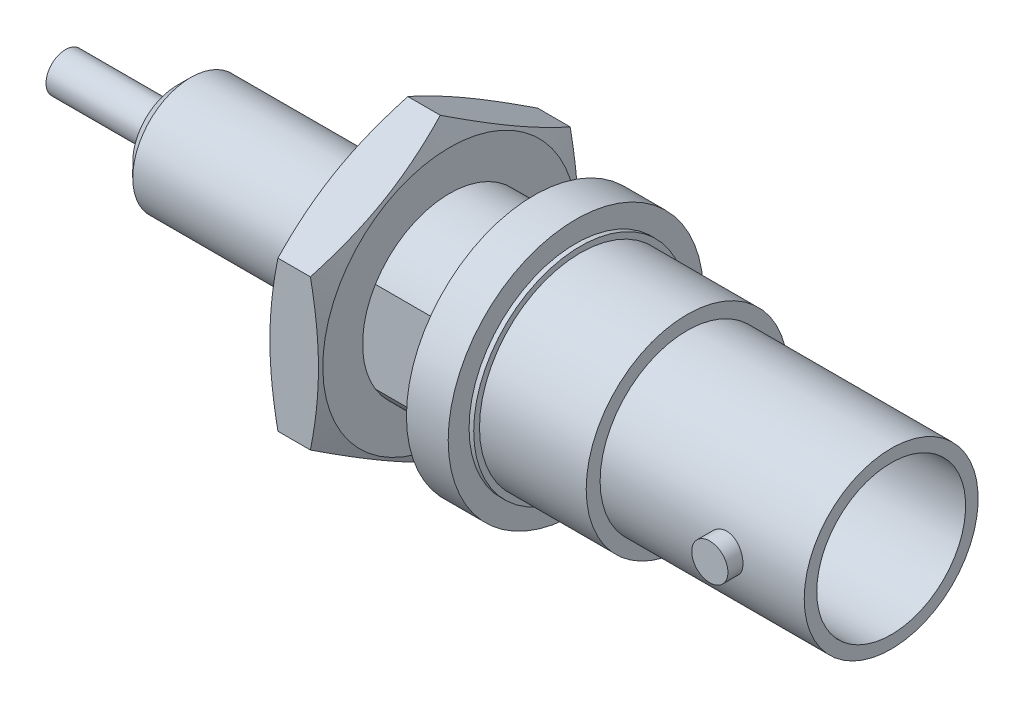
ISO-10303-21;
HEADER;
FILE_DESCRIPTION(('STEP AP214'),'2;1');
FILE_NAME('part.step','',(''),(''),'','','');
FILE_SCHEMA(('AUTOMOTIVE_DESIGN { 1 0 10303 214 1 1 1 1 }'));
ENDSEC;
DATA;
#1=APPLICATION_CONTEXT('core data for automotive mechanical design processes');
#2=APPLICATION_PROTOCOL_DEFINITION('international standard','automotive_design',2000,#1);
#3=PRODUCT_CONTEXT('',#1,'mechanical');
#4=PRODUCT('Part','Part','',(#3));
#5=PRODUCT_RELATED_PRODUCT_CATEGORY('part','',(#4));
#6=PRODUCT_DEFINITION_FORMATION('','',#4);
#7=PRODUCT_DEFINITION_CONTEXT('part definition',#1,'design');
#8=PRODUCT_DEFINITION('design','',#6,#7);
#9=PRODUCT_DEFINITION_SHAPE('','',#8);
#10=(LENGTH_UNIT() NAMED_UNIT(*) SI_UNIT(.MILLI.,.METRE.));
#11=(NAMED_UNIT(*) PLANE_ANGLE_UNIT() SI_UNIT($,.RADIAN.));
#12=(NAMED_UNIT(*) SI_UNIT($,.STERADIAN.) SOLID_ANGLE_UNIT());
#13=UNCERTAINTY_MEASURE_WITH_UNIT(LENGTH_MEASURE(1.E-05),#10,'distance_accuracy_value','');
#14=(GEOMETRIC_REPRESENTATION_CONTEXT(3) GLOBAL_UNCERTAINTY_ASSIGNED_CONTEXT((#13)) GLOBAL_UNIT_ASSIGNED_CONTEXT((#10,
#11,#12)) REPRESENTATION_CONTEXT('',''));
#15=CARTESIAN_POINT('',(0.,0.,0.));
#16=DIRECTION('',(0.,0.,1.));
#17=DIRECTION('',(1.,0.,0.));
#18=AXIS2_PLACEMENT_3D('',#15,#16,#17);
#19=CARTESIAN_POINT('',(0.,0.,0.));
#20=DIRECTION('',(-1.,0.,0.));
#21=DIRECTION('',(0.,0.,1.));
#22=AXIS2_PLACEMENT_3D('',#19,#20,#21);
#23=CYLINDRICAL_SURFACE('',#22,4.7625);
#24=CARTESIAN_POINT('',(-4.6228,0.,0.));
#25=DIRECTION('',(-1.,0.,0.));
#26=DIRECTION('',(0.,0.,1.));
#27=AXIS2_PLACEMENT_3D('',#24,#25,#26);
#28=CIRCLE('',#27,4.7625);
#29=CARTESIAN_POINT('',(-4.6228,2.48300427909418,4.064));
#30=VERTEX_POINT('',#29);
#31=CARTESIAN_POINT('',(-4.6228,-2.48300427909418,4.064));
#32=VERTEX_POINT('',#31);
#33=EDGE_CURVE('E301',#30,#32,#28,.T.);
#34=ORIENTED_EDGE('',*,*,#33,.F.);
#35=DIRECTION('',(-1.,0.,0.));
#36=VECTOR('',#35,1.);
#37=CARTESIAN_POINT('',(0.,2.48300427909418,4.064));
#38=LINE('',#37,#36);
#39=CARTESIAN_POINT('',(0.,2.48300427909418,4.064));
#40=VERTEX_POINT('',#39);
#41=EDGE_CURVE('E156',#40,#30,#38,.T.);
#42=ORIENTED_EDGE('',*,*,#41,.F.);
#43=CARTESIAN_POINT('',(0.,0.,0.));
#44=DIRECTION('',(-1.,0.,0.));
#45=DIRECTION('',(0.,0.,1.));
#46=AXIS2_PLACEMENT_3D('',#43,#44,#45);
#47=CIRCLE('',#46,4.7625);
#48=CARTESIAN_POINT('',(0.,-2.48300427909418,4.064));
#49=VERTEX_POINT('',#48);
#50=EDGE_CURVE('E178',#40,#49,#47,.T.);
#51=ORIENTED_EDGE('',*,*,#50,.T.);
#52=DIRECTION('',(-1.,0.,0.));
#53=VECTOR('',#52,1.);
#54=CARTESIAN_POINT('',(0.,-2.48300427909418,4.064));
#55=LINE('',#54,#53);
#56=EDGE_CURVE('E150',#32,#49,#55,.F.);
#57=ORIENTED_EDGE('',*,*,#56,.F.);
#58=EDGE_LOOP('',(#34,#42,#51,#57));
#59=FACE_BOUND('',#58,.T.);
#60=ADVANCED_FACE('F37',(#59),#23,.T.);
#61=CARTESIAN_POINT('',(-7.4168,2.48300427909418,4.064));
#62=VERTEX_POINT('',#61);
#63=CARTESIAN_POINT('',(-8.5852,2.48300427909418,4.064));
#64=VERTEX_POINT('',#63);
#65=EDGE_CURVE('E154',#62,#64,#38,.T.);
#66=ORIENTED_EDGE('',*,*,#65,.F.);
#67=CARTESIAN_POINT('',(-7.4168,0.,0.));
#68=DIRECTION('',(-1.,0.,0.));
#69=DIRECTION('',(0.,0.,1.));
#70=AXIS2_PLACEMENT_3D('',#67,#68,#69);
#71=CIRCLE('',#70,4.7625);
#72=CARTESIAN_POINT('',(-7.4168,-2.48300427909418,4.064));
#73=VERTEX_POINT('',#72);
#74=EDGE_CURVE('E321',#62,#73,#71,.T.);
#75=ORIENTED_EDGE('',*,*,#74,.T.);
#76=CARTESIAN_POINT('',(-8.5852,-2.48300427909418,4.064));
#77=VERTEX_POINT('',#76);
#78=EDGE_CURVE('E151',#77,#73,#55,.F.);
#79=ORIENTED_EDGE('',*,*,#78,.F.);
#80=CARTESIAN_POINT('',(-8.5852,0.,0.));
#81=DIRECTION('',(-1.,0.,0.));
#82=DIRECTION('',(0.,0.,1.));
#83=AXIS2_PLACEMENT_3D('',#80,#81,#82);
#84=CIRCLE('',#83,4.7625);
#85=EDGE_CURVE('E175',#64,#77,#84,.T.);
#86=ORIENTED_EDGE('',*,*,#85,.F.);
#87=EDGE_LOOP('',(#66,#75,#79,#86));
#88=FACE_BOUND('',#87,.T.);
#89=ADVANCED_FACE('F255',(#88),#23,.T.);
#90=CARTESIAN_POINT('',(-8.5852,3.175,0.));
#91=DIRECTION('',(1.,0.,0.));
#92=DIRECTION('',(0.,0.,-1.));
#93=AXIS2_PLACEMENT_3D('',#90,#91,#92);
#94=PLANE('',#93);
#95=CARTESIAN_POINT('',(-8.5852,0.,0.));
#96=DIRECTION('',(-1.,0.,0.));
#97=DIRECTION('',(0.,0.,1.));
#98=AXIS2_PLACEMENT_3D('',#95,#96,#97);
#99=CIRCLE('',#98,3.175);
#100=CARTESIAN_POINT('',(-8.5852,0.,3.175));
#101=VERTEX_POINT('',#100);
#102=EDGE_CURVE('E172',#101,#101,#99,.T.);
#103=ORIENTED_EDGE('',*,*,#102,.F.);
#104=EDGE_LOOP('',(#103));
#105=FACE_BOUND('',#104,.T.);
#106=DIRECTION('',(0.,-1.,0.));
#107=VECTOR('',#106,1.);
#108=CARTESIAN_POINT('',(-8.5852,3.175,4.064));
#109=LINE('',#108,#107);
#110=EDGE_CURVE('E634',#64,#77,#109,.T.);
#111=ORIENTED_EDGE('',*,*,#110,.F.);
#112=ORIENTED_EDGE('',*,*,#85,.T.);
#113=EDGE_LOOP('',(#111,#112));
#114=FACE_BOUND('',#113,.T.);
#115=ADVANCED_FACE('F251',(#105,#114),#94,.F.);
#116=CARTESIAN_POINT('',(0.,0.,0.));
#117=DIRECTION('',(-1.,0.,0.));
#118=DIRECTION('',(0.,0.,1.));
#119=AXIS2_PLACEMENT_3D('',#116,#117,#118);
#120=CYLINDRICAL_SURFACE('',#119,4.0767);
#121=CARTESIAN_POINT('',(19.558,0.,0.));
#122=DIRECTION('',(-1.,0.,0.));
#123=DIRECTION('',(0.,0.,1.));
#124=AXIS2_PLACEMENT_3D('',#121,#122,#123);
#125=CIRCLE('',#124,4.0767);
#126=CARTESIAN_POINT('',(19.558,0.,4.0767));
#127=VERTEX_POINT('',#126);
#128=EDGE_CURVE('E205',#127,#127,#125,.T.);
#129=ORIENTED_EDGE('',*,*,#128,.F.);
#130=EDGE_LOOP('',(#129));
#131=FACE_BOUND('',#130,.T.);
#132=CARTESIAN_POINT('',(2.286,0.,0.));
#133=DIRECTION('',(-1.,0.,0.));
#134=DIRECTION('',(0.,0.,1.));
#135=AXIS2_PLACEMENT_3D('',#132,#133,#134);
#136=CIRCLE('',#135,4.0767);
#137=CARTESIAN_POINT('',(2.286,0.,4.0767));
#138=VERTEX_POINT('',#137);
#139=EDGE_CURVE('E208',#138,#138,#136,.T.);
#140=ORIENTED_EDGE('',*,*,#139,.T.);
#141=EDGE_LOOP('',(#140));
#142=FACE_BOUND('',#141,.T.);
#143=ADVANCED_FACE('F254',(#131,#142),#120,.F.);
#144=CARTESIAN_POINT('',(0.,0.,0.));
#145=DIRECTION('',(-1.,0.,0.));
#146=DIRECTION('',(0.,0.,1.));
#147=AXIS2_PLACEMENT_3D('',#144,#145,#146);
#148=CYLINDRICAL_SURFACE('',#147,4.7625);
#149=CARTESIAN_POINT('',(14.224,0.,-4.7625));
#150=CARTESIAN_POINT('',(14.2240019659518,0.0550072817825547,-4.76249898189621));
#151=CARTESIAN_POINT('',(14.2285972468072,0.110038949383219,-4.76153725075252));
#152=CARTESIAN_POINT('',(14.2468404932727,0.218543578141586,-4.75779353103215));
#153=CARTESIAN_POINT('',(14.2604953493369,0.272015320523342,-4.75501015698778));
#154=CARTESIAN_POINT('',(14.296415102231,0.37581590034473,-4.74793358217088));
#155=CARTESIAN_POINT('',(14.3186714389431,0.426147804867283,-4.74364188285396));
#156=CARTESIAN_POINT('',(14.3711362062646,0.522360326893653,-4.73401380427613));
#157=CARTESIAN_POINT('',(14.4013442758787,0.568241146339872,-4.72867747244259));
#158=CARTESIAN_POINT('',(14.4693219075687,0.65492126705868,-4.71745925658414));
#159=CARTESIAN_POINT('',(14.5071851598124,0.695646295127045,-4.71157115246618));
#160=CARTESIAN_POINT('',(14.5891970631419,0.770215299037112,-4.6999576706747));
#161=CARTESIAN_POINT('',(14.633346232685,0.804058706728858,-4.6942323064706));
#162=CARTESIAN_POINT('',(14.7272172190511,0.86422473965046,-4.68353157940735));
#163=CARTESIAN_POINT('',(14.7769898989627,0.890469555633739,-4.67856420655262));
#164=CARTESIAN_POINT('',(14.8803591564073,0.934194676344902,-4.67003063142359));
#165=CARTESIAN_POINT('',(14.9339553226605,0.951675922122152,-4.6664642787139));
#166=CARTESIAN_POINT('',(15.0426482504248,0.977134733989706,-4.66119965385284));
#167=CARTESIAN_POINT('',(15.0977131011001,0.985243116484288,-4.65947569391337));
#168=CARTESIAN_POINT('',(15.2084465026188,0.992132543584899,-4.65801380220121));
#169=CARTESIAN_POINT('',(15.264114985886,0.990914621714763,-4.65827565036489));
#170=CARTESIAN_POINT('',(15.3735119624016,0.979291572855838,-4.66073248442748));
#171=CARTESIAN_POINT('',(15.4272572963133,0.969037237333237,-4.66289573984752));
#172=CARTESIAN_POINT('',(15.5322477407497,0.939870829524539,-4.66886159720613));
#173=CARTESIAN_POINT('',(15.583492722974,0.920958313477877,-4.67266428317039));
#174=CARTESIAN_POINT('',(15.682457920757,0.874870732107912,-4.68151248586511));
#175=CARTESIAN_POINT('',(15.7301498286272,0.84763664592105,-4.686566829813));
#176=CARTESIAN_POINT('',(15.8203429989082,0.785720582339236,-4.69734329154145));
#177=CARTESIAN_POINT('',(15.8628436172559,0.751037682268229,-4.7030654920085));
#178=CARTESIAN_POINT('',(15.9423170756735,0.674404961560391,-4.71466983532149));
#179=CARTESIAN_POINT('',(15.9791659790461,0.632326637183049,-4.72055292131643));
#180=CARTESIAN_POINT('',(16.0453028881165,0.542522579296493,-4.73171423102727));
#181=CARTESIAN_POINT('',(16.0745907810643,0.494796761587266,-4.73699244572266));
#182=CARTESIAN_POINT('',(16.1248004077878,0.394909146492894,-4.74636394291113));
#183=CARTESIAN_POINT('',(16.1457071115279,0.342739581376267,-4.75045509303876));
#184=CARTESIAN_POINT('',(16.1784241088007,0.235524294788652,-4.75697546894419));
#185=CARTESIAN_POINT('',(16.1902355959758,0.180478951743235,-4.7594049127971));
#186=CARTESIAN_POINT('',(16.2042494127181,0.070138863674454,-4.76229749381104));
#187=CARTESIAN_POINT('',(16.20662122,0.0148665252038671,-4.76279530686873));
#188=CARTESIAN_POINT('',(16.2021459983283,-0.0952846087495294,-4.76186520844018));
#189=CARTESIAN_POINT('',(16.1952995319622,-0.150163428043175,-4.76043741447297));
#190=CARTESIAN_POINT('',(16.1727228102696,-0.257416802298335,-4.75583830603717));
#191=CARTESIAN_POINT('',(16.1570803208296,-0.309810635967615,-4.75268422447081));
#192=CARTESIAN_POINT('',(16.1174521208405,-0.411231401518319,-4.74498514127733));
#193=CARTESIAN_POINT('',(16.0934657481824,-0.460258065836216,-4.74044002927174));
#194=CARTESIAN_POINT('',(16.0374696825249,-0.554261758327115,-4.73037698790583));
#195=CARTESIAN_POINT('',(16.0053589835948,-0.599177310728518,-4.72484709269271));
#196=CARTESIAN_POINT('',(15.9341600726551,-0.683043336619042,-4.71345440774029));
#197=CARTESIAN_POINT('',(15.8950710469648,-0.721993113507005,-4.70759157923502));
#198=CARTESIAN_POINT('',(15.810250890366,-0.793482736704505,-4.69607570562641));
#199=CARTESIAN_POINT('',(15.7644205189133,-0.825905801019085,-4.69042773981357));
#200=CARTESIAN_POINT('',(15.6678648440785,-0.882594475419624,-4.68009261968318));
#201=CARTESIAN_POINT('',(15.6171397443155,-0.906860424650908,-4.67540542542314));
#202=CARTESIAN_POINT('',(15.5124982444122,-0.946390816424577,-4.66756438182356));
#203=CARTESIAN_POINT('',(15.4586008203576,-0.96170377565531,-4.66440228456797));
#204=CARTESIAN_POINT('',(15.3489245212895,-0.983038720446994,-4.65995300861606));
#205=CARTESIAN_POINT('',(15.2931459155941,-0.989062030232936,-4.65866556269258));
#206=CARTESIAN_POINT('',(15.182465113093,-0.991594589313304,-4.65812703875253));
#207=CARTESIAN_POINT('',(15.1275672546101,-0.988288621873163,-4.65883640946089));
#208=CARTESIAN_POINT('',(15.0191287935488,-0.972666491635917,-4.66212277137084));
#209=CARTESIAN_POINT('',(14.9655881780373,-0.960350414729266,-4.66469974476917));
#210=CARTESIAN_POINT('',(14.8615137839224,-0.92714300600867,-4.67141259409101));
#211=CARTESIAN_POINT('',(14.8109719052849,-0.906276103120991,-4.67554402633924));
#212=CARTESIAN_POINT('',(14.7140781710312,-0.856581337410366,-4.68490247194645));
#213=CARTESIAN_POINT('',(14.6677267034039,-0.82775273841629,-4.69012958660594));
#214=CARTESIAN_POINT('',(14.5796132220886,-0.762329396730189,-4.70121025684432));
#215=CARTESIAN_POINT('',(14.5379509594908,-0.725601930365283,-4.70707354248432));
#216=CARTESIAN_POINT('',(14.4613199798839,-0.645695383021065,-4.71869797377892));
#217=CARTESIAN_POINT('',(14.4263528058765,-0.60251481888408,-4.72445909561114));
#218=CARTESIAN_POINT('',(14.3637229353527,-0.510330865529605,-4.73530832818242));
#219=CARTESIAN_POINT('',(14.3361487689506,-0.461266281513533,-4.74038794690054));
#220=CARTESIAN_POINT('',(14.2896813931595,-0.359105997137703,-4.74921764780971));
#221=CARTESIAN_POINT('',(14.2707805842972,-0.306013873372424,-4.752968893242));
#222=CARTESIAN_POINT('',(14.2457360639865,-0.210690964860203,-4.75801503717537));
#223=CARTESIAN_POINT('',(14.237599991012,-0.16899207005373,-4.75968681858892));
#224=CARTESIAN_POINT('',(14.2267312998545,-0.0848669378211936,-4.76192967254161));
#225=CARTESIAN_POINT('',(14.2239984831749,-0.0424407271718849,-4.76250078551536));
#226=CARTESIAN_POINT('',(14.224,0.,-4.7625));
#227=B_SPLINE_CURVE_WITH_KNOTS('',3,(#149,#150,#151,#152,#153,#154,#155,#156,#157,#158,#159,
#160,#161,#162,#163,#164,#165,#166,#167,#168,#169,#170,#171,#172,#173,#174,#175,#176,#177,#178,
#179,#180,#181,#182,#183,#184,#185,#186,#187,#188,#189,#190,#191,#192,#193,#194,#195,#196,#197,
#198,#199,#200,#201,#202,#203,#204,#205,#206,#207,#208,#209,#210,#211,#212,#213,#214,#215,#216,
#217,#218,#219,#220,#221,#222,#223,#224,#225,#226),.UNSPECIFIED.,.T.,.F.,(4,2,2,2,2,2,2,2,2,2,2,
2,2,2,2,2,2,2,2,2,2,2,2,2,2,2,2,2,2,2,2,2,2,2,2,2,2,2,4),(0.,0.164866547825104,
0.329858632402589,0.49468693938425,0.659507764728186,0.826483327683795,0.993472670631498,
1.1621159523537,1.33074112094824,1.49698324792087,1.66320695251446,1.82670830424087,
1.99021803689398,2.15491549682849,2.31963336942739,2.48756287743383,2.65549488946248,
2.82372672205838,2.99193647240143,3.15711222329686,3.32227789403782,3.48582407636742,
3.64938323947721,3.81508539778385,3.98080688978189,4.14927170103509,4.31772950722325,
4.48526576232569,4.65277813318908,4.81699603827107,4.98121237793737,5.14496280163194,
5.30872837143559,5.47549713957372,5.64230429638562,5.81102776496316,5.97960311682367,
6.10681015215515,6.23401251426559),.UNSPECIFIED.);
#228=CARTESIAN_POINT('',(14.224,0.,-4.7625));
#229=VERTEX_POINT('',#228);
#230=EDGE_CURVE('E211',#229,#229,#227,.T.);
#231=ORIENTED_EDGE('',*,*,#230,.F.);
#232=EDGE_LOOP('',(#231));
#233=FACE_BOUND('',#232,.T.);
#234=CARTESIAN_POINT('',(8.382,0.,0.));
#235=DIRECTION('',(-1.,0.,0.));
#236=DIRECTION('',(0.,0.,1.));
#237=AXIS2_PLACEMENT_3D('',#234,#235,#236);
#238=CIRCLE('',#237,4.7625);
#239=CARTESIAN_POINT('',(8.382,0.,4.7625));
#240=VERTEX_POINT('',#239);
#241=EDGE_CURVE('E199',#240,#240,#238,.T.);
#242=ORIENTED_EDGE('',*,*,#241,.F.);
#243=EDGE_LOOP('',(#242));
#244=FACE_BOUND('',#243,.T.);
#245=CARTESIAN_POINT('',(19.558,0.,0.));
#246=DIRECTION('',(-1.,0.,0.));
#247=DIRECTION('',(0.,0.,1.));
#248=AXIS2_PLACEMENT_3D('',#245,#246,#247);
#249=CIRCLE('',#248,4.7625);
#250=CARTESIAN_POINT('',(19.558,0.,4.7625));
#251=VERTEX_POINT('',#250);
#252=EDGE_CURVE('E202',#251,#251,#249,.T.);
#253=ORIENTED_EDGE('',*,*,#252,.T.);
#254=EDGE_LOOP('',(#253));
#255=FACE_BOUND('',#254,.T.);
#256=CARTESIAN_POINT('',(16.2052,0.,4.7625));
#257=CARTESIAN_POINT('',(16.2051980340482,0.0550072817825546,4.76249898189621));
#258=CARTESIAN_POINT('',(16.2006027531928,0.110038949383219,4.76153725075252));
#259=CARTESIAN_POINT('',(16.1823595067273,0.218543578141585,4.75779353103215));
#260=CARTESIAN_POINT('',(16.168704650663,0.272015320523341,4.75501015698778));
#261=CARTESIAN_POINT('',(16.1327848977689,0.37581590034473,4.74793358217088));
#262=CARTESIAN_POINT('',(16.1105285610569,0.426147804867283,4.74364188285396));
#263=CARTESIAN_POINT('',(16.0580637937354,0.522360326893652,4.73401380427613));
#264=CARTESIAN_POINT('',(16.0278557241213,0.568241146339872,4.72867747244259));
#265=CARTESIAN_POINT('',(15.9598780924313,0.654921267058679,4.71745925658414));
#266=CARTESIAN_POINT('',(15.9220148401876,0.695646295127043,4.71157115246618));
#267=CARTESIAN_POINT('',(15.8400029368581,0.77021529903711,4.6999576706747));
#268=CARTESIAN_POINT('',(15.7958537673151,0.804058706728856,4.6942323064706));
#269=CARTESIAN_POINT('',(15.7019827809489,0.864224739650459,4.68353157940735));
#270=CARTESIAN_POINT('',(15.6522101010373,0.890469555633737,4.67856420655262));
#271=CARTESIAN_POINT('',(15.5488408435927,0.934194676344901,4.67003063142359));
#272=CARTESIAN_POINT('',(15.4952446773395,0.951675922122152,4.6664642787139));
#273=CARTESIAN_POINT('',(15.3865517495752,0.977134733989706,4.66119965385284));
#274=CARTESIAN_POINT('',(15.3314868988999,0.985243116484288,4.65947569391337));
#275=CARTESIAN_POINT('',(15.2207534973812,0.992132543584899,4.65801380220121));
#276=CARTESIAN_POINT('',(15.165085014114,0.990914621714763,4.65827565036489));
#277=CARTESIAN_POINT('',(15.0556880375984,0.979291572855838,4.66073248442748));
#278=CARTESIAN_POINT('',(15.0019427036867,0.969037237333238,4.66289573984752));
#279=CARTESIAN_POINT('',(14.8969522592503,0.939870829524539,4.66886159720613));
#280=CARTESIAN_POINT('',(14.845707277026,0.920958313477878,4.67266428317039));
#281=CARTESIAN_POINT('',(14.746742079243,0.874870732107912,4.68151248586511));
#282=CARTESIAN_POINT('',(14.6990501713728,0.84763664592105,4.686566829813));
#283=CARTESIAN_POINT('',(14.6088570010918,0.785720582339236,4.69734329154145));
#284=CARTESIAN_POINT('',(14.5663563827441,0.751037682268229,4.7030654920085));
#285=CARTESIAN_POINT('',(14.4868829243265,0.674404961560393,4.71466983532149));
#286=CARTESIAN_POINT('',(14.4500340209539,0.632326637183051,4.72055292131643));
#287=CARTESIAN_POINT('',(14.3838971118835,0.542522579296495,4.73171423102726));
#288=CARTESIAN_POINT('',(14.3546092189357,0.494796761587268,4.73699244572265));
#289=CARTESIAN_POINT('',(14.3043995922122,0.394909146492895,4.74636394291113));
#290=CARTESIAN_POINT('',(14.2834928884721,0.342739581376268,4.75045509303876));
#291=CARTESIAN_POINT('',(14.2507758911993,0.235524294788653,4.75697546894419));
#292=CARTESIAN_POINT('',(14.2389644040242,0.180478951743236,4.7594049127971));
#293=CARTESIAN_POINT('',(14.2249505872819,0.0701388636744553,4.76229749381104));
#294=CARTESIAN_POINT('',(14.22257878,0.0148665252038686,4.76279530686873));
#295=CARTESIAN_POINT('',(14.2270540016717,-0.095284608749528,4.76186520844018));
#296=CARTESIAN_POINT('',(14.2339004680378,-0.150163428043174,4.76043741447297));
#297=CARTESIAN_POINT('',(14.2564771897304,-0.257416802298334,4.75583830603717));
#298=CARTESIAN_POINT('',(14.2721196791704,-0.309810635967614,4.75268422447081));
#299=CARTESIAN_POINT('',(14.3117478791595,-0.411231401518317,4.74498514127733));
#300=CARTESIAN_POINT('',(14.3357342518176,-0.460258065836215,4.74044002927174));
#301=CARTESIAN_POINT('',(14.3917303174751,-0.554261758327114,4.73037698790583));
#302=CARTESIAN_POINT('',(14.4238410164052,-0.599177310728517,4.72484709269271));
#303=CARTESIAN_POINT('',(14.4950399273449,-0.683043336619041,4.71345440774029));
#304=CARTESIAN_POINT('',(14.5341289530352,-0.721993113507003,4.70759157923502));
#305=CARTESIAN_POINT('',(14.618949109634,-0.793482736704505,4.69607570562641));
#306=CARTESIAN_POINT('',(14.6647794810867,-0.825905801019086,4.69042773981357));
#307=CARTESIAN_POINT('',(14.7613351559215,-0.882594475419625,4.68009261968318));
#308=CARTESIAN_POINT('',(14.8120602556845,-0.906860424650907,4.67540542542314));
#309=CARTESIAN_POINT('',(14.9167017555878,-0.946390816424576,4.66756438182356));
#310=CARTESIAN_POINT('',(14.9705991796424,-0.961703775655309,4.66440228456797));
#311=CARTESIAN_POINT('',(15.0802754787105,-0.983038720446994,4.65995300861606));
#312=CARTESIAN_POINT('',(15.1360540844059,-0.989062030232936,4.65866556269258));
#313=CARTESIAN_POINT('',(15.246734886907,-0.991594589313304,4.65812703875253));
#314=CARTESIAN_POINT('',(15.3016327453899,-0.988288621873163,4.65883640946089));
#315=CARTESIAN_POINT('',(15.4100712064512,-0.972666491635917,4.66212277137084));
#316=CARTESIAN_POINT('',(15.4636118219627,-0.960350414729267,4.66469974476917));
#317=CARTESIAN_POINT('',(15.5676862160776,-0.92714300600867,4.67141259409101));
#318=CARTESIAN_POINT('',(15.6182280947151,-0.906276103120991,4.67554402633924));
#319=CARTESIAN_POINT('',(15.7151218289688,-0.856581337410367,4.68490247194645));
#320=CARTESIAN_POINT('',(15.7614732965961,-0.827752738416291,4.69012958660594));
#321=CARTESIAN_POINT('',(15.8495867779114,-0.762329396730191,4.70121025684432));
#322=CARTESIAN_POINT('',(15.8912490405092,-0.725601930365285,4.70707354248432));
#323=CARTESIAN_POINT('',(15.9678800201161,-0.645695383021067,4.71869797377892));
#324=CARTESIAN_POINT('',(16.0028471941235,-0.602514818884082,4.72445909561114));
#325=CARTESIAN_POINT('',(16.0654770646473,-0.510330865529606,4.73530832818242));
#326=CARTESIAN_POINT('',(16.0930512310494,-0.461266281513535,4.74038794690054));
#327=CARTESIAN_POINT('',(16.1395186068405,-0.359105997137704,4.74921764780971));
#328=CARTESIAN_POINT('',(16.1584194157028,-0.306013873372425,4.752968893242));
#329=CARTESIAN_POINT('',(16.1834639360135,-0.210690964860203,4.75801503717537));
#330=CARTESIAN_POINT('',(16.191600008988,-0.168992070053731,4.75968681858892));
#331=CARTESIAN_POINT('',(16.2024687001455,-0.0848669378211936,4.76192967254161));
#332=CARTESIAN_POINT('',(16.2052015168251,-0.0424407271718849,4.76250078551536));
#333=CARTESIAN_POINT('',(16.2052,0.,4.7625));
#334=B_SPLINE_CURVE_WITH_KNOTS('',3,(#256,#257,#258,#259,#260,#261,#262,#263,#264,#265,#266,
#267,#268,#269,#270,#271,#272,#273,#274,#275,#276,#277,#278,#279,#280,#281,#282,#283,#284,#285,
#286,#287,#288,#289,#290,#291,#292,#293,#294,#295,#296,#297,#298,#299,#300,#301,#302,#303,#304,
#305,#306,#307,#308,#309,#310,#311,#312,#313,#314,#315,#316,#317,#318,#319,#320,#321,#322,#323,
#324,#325,#326,#327,#328,#329,#330,#331,#332,#333),.UNSPECIFIED.,.T.,.F.,(4,2,2,2,2,2,2,2,2,2,2,
2,2,2,2,2,2,2,2,2,2,2,2,2,2,2,2,2,2,2,2,2,2,2,2,2,2,2,4),(0.,0.164866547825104,
0.329858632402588,0.49468693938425,0.659507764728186,0.826483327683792,0.993472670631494,
1.16211595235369,1.33074112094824,1.49698324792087,1.66320695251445,1.82670830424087,
1.99021803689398,2.15491549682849,2.31963336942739,2.48756287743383,2.65549488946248,
2.82372672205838,2.99193647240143,3.15711222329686,3.32227789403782,3.48582407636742,
3.64938323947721,3.81508539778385,3.98080688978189,4.14927170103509,4.31772950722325,
4.48526576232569,4.65277813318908,4.81699603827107,4.98121237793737,5.14496280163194,
5.30872837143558,5.47549713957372,5.64230429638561,5.81102776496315,5.97960311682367,
6.10681015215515,6.23401251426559),.UNSPECIFIED.);
#335=CARTESIAN_POINT('',(16.2052,0.,4.7625));
#336=VERTEX_POINT('',#335);
#337=EDGE_CURVE('E218',#336,#336,#334,.T.);
#338=ORIENTED_EDGE('',*,*,#337,.F.);
#339=EDGE_LOOP('',(#338));
#340=FACE_BOUND('',#339,.T.);
#341=ADVANCED_FACE('F222',(#233,#244,#255,#340),#148,.T.);
#342=CARTESIAN_POINT('',(-25.654,1.0668,0.));
#343=DIRECTION('',(1.,0.,0.));
#344=DIRECTION('',(0.,0.,-1.));
#345=AXIS2_PLACEMENT_3D('',#342,#343,#344);
#346=PLANE('',#345);
#347=CARTESIAN_POINT('',(-25.654,0.,0.));
#348=DIRECTION('',(-1.,0.,0.));
#349=DIRECTION('',(0.,0.,1.));
#350=AXIS2_PLACEMENT_3D('',#347,#348,#349);
#351=CIRCLE('',#350,1.0668);
#352=CARTESIAN_POINT('',(-25.654,0.,1.0668));
#353=VERTEX_POINT('',#352);
#354=EDGE_CURVE('E164',#353,#353,#351,.T.);
#355=ORIENTED_EDGE('',*,*,#354,.T.);
#356=EDGE_LOOP('',(#355));
#357=FACE_BOUND('',#356,.T.);
#358=ADVANCED_FACE('F539',(#357),#346,.F.);
#359=CARTESIAN_POINT('',(2.286,4.0767,0.));
#360=DIRECTION('',(-1.,0.,0.));
#361=DIRECTION('',(0.,0.,1.));
#362=AXIS2_PLACEMENT_3D('',#359,#360,#361);
#363=PLANE('',#362);
#364=ORIENTED_EDGE('',*,*,#139,.F.);
#365=EDGE_LOOP('',(#364));
#366=FACE_BOUND('',#365,.T.);
#367=ADVANCED_FACE('F289',(#366),#363,.F.);
#368=CARTESIAN_POINT('',(19.558,4.7625,0.));
#369=DIRECTION('',(-1.,0.,0.));
#370=DIRECTION('',(0.,0.,1.));
#371=AXIS2_PLACEMENT_3D('',#368,#369,#370);
#372=PLANE('',#371);
#373=ORIENTED_EDGE('',*,*,#252,.F.);
#374=EDGE_LOOP('',(#373));
#375=FACE_BOUND('',#374,.T.);
#376=ORIENTED_EDGE('',*,*,#128,.T.);
#377=EDGE_LOOP('',(#376));
#378=FACE_BOUND('',#377,.T.);
#379=ADVANCED_FACE('F284',(#375,#378),#372,.F.);
#380=CARTESIAN_POINT('',(8.382,5.5245,0.));
#381=DIRECTION('',(-1.,0.,0.));
#382=DIRECTION('',(0.,0.,1.));
#383=AXIS2_PLACEMENT_3D('',#380,#381,#382);
#384=PLANE('',#383);
#385=CARTESIAN_POINT('',(8.382,0.,0.));
#386=DIRECTION('',(-1.,0.,0.));
#387=DIRECTION('',(0.,0.,1.));
#388=AXIS2_PLACEMENT_3D('',#385,#386,#387);
#389=CIRCLE('',#388,5.5245);
#390=CARTESIAN_POINT('',(8.382,0.,5.5245));
#391=VERTEX_POINT('',#390);
#392=EDGE_CURVE('E196',#391,#391,#389,.T.);
#393=ORIENTED_EDGE('',*,*,#392,.F.);
#394=EDGE_LOOP('',(#393));
#395=FACE_BOUND('',#394,.T.);
#396=ORIENTED_EDGE('',*,*,#241,.T.);
#397=EDGE_LOOP('',(#396));
#398=FACE_BOUND('',#397,.T.);
#399=ADVANCED_FACE('F281',(#395,#398),#384,.F.);
#400=CARTESIAN_POINT('',(0.,0.,0.));
#401=DIRECTION('',(-1.,0.,0.));
#402=DIRECTION('',(0.,0.,1.));
#403=AXIS2_PLACEMENT_3D('',#400,#401,#402);
#404=CYLINDRICAL_SURFACE('',#403,5.5245);
#405=CARTESIAN_POINT('',(2.54,0.,0.));
#406=DIRECTION('',(-1.,0.,0.));
#407=DIRECTION('',(0.,0.,1.));
#408=AXIS2_PLACEMENT_3D('',#405,#406,#407);
#409=CIRCLE('',#408,5.5245);
#410=CARTESIAN_POINT('',(2.54,0.,5.5245));
#411=VERTEX_POINT('',#410);
#412=EDGE_CURVE('E193',#411,#411,#409,.T.);
#413=ORIENTED_EDGE('',*,*,#412,.F.);
#414=EDGE_LOOP('',(#413));
#415=FACE_BOUND('',#414,.T.);
#416=ORIENTED_EDGE('',*,*,#392,.T.);
#417=EDGE_LOOP('',(#416));
#418=FACE_BOUND('',#417,.T.);
#419=ADVANCED_FACE('F278',(#415,#418),#404,.T.);
#420=CARTESIAN_POINT('',(2.54,5.842,0.));
#421=DIRECTION('',(-1.,0.,0.));
#422=DIRECTION('',(0.,0.,1.));
#423=AXIS2_PLACEMENT_3D('',#420,#421,#422);
#424=PLANE('',#423);
#425=CARTESIAN_POINT('',(2.54,0.,0.));
#426=DIRECTION('',(-1.,0.,0.));
#427=DIRECTION('',(0.,0.,1.));
#428=AXIS2_PLACEMENT_3D('',#425,#426,#427);
#429=CIRCLE('',#428,5.842);
#430=CARTESIAN_POINT('',(2.54,0.,5.842));
#431=VERTEX_POINT('',#430);
#432=EDGE_CURVE('E190',#431,#431,#429,.T.);
#433=ORIENTED_EDGE('',*,*,#432,.F.);
#434=EDGE_LOOP('',(#433));
#435=FACE_BOUND('',#434,.T.);
#436=ORIENTED_EDGE('',*,*,#412,.T.);
#437=EDGE_LOOP('',(#436));
#438=FACE_BOUND('',#437,.T.);
#439=ADVANCED_FACE('F274',(#435,#438),#424,.F.);
#440=CARTESIAN_POINT('',(0.,0.,0.));
#441=DIRECTION('',(-1.,0.,0.));
#442=DIRECTION('',(0.,0.,1.));
#443=AXIS2_PLACEMENT_3D('',#440,#441,#442);
#444=CYLINDRICAL_SURFACE('',#443,5.842);
#445=CARTESIAN_POINT('',(2.286,0.,0.));
#446=DIRECTION('',(-1.,0.,0.));
#447=DIRECTION('',(0.,0.,1.));
#448=AXIS2_PLACEMENT_3D('',#445,#446,#447);
#449=CIRCLE('',#448,5.842);
#450=CARTESIAN_POINT('',(2.286,0.,5.842));
#451=VERTEX_POINT('',#450);
#452=EDGE_CURVE('E187',#451,#451,#449,.T.);
#453=ORIENTED_EDGE('',*,*,#452,.F.);
#454=EDGE_LOOP('',(#453));
#455=FACE_BOUND('',#454,.T.);
#456=ORIENTED_EDGE('',*,*,#432,.T.);
#457=EDGE_LOOP('',(#456));
#458=FACE_BOUND('',#457,.T.);
#459=ADVANCED_FACE('F270',(#455,#458),#444,.T.);
#460=CARTESIAN_POINT('',(2.286,6.985,0.));
#461=DIRECTION('',(-1.,0.,0.));
#462=DIRECTION('',(0.,0.,1.));
#463=AXIS2_PLACEMENT_3D('',#460,#461,#462);
#464=PLANE('',#463);
#465=CARTESIAN_POINT('',(2.286,0.,0.));
#466=DIRECTION('',(-1.,0.,0.));
#467=DIRECTION('',(0.,0.,1.));
#468=AXIS2_PLACEMENT_3D('',#465,#466,#467);
#469=CIRCLE('',#468,6.985);
#470=CARTESIAN_POINT('',(2.286,0.,6.985));
#471=VERTEX_POINT('',#470);
#472=EDGE_CURVE('E184',#471,#471,#469,.T.);
#473=ORIENTED_EDGE('',*,*,#472,.F.);
#474=EDGE_LOOP('',(#473));
#475=FACE_BOUND('',#474,.T.);
#476=ORIENTED_EDGE('',*,*,#452,.T.);
#477=EDGE_LOOP('',(#476));
#478=FACE_BOUND('',#477,.T.);
#479=ADVANCED_FACE('F266',(#475,#478),#464,.F.);
#480=CARTESIAN_POINT('',(0.,0.,0.));
#481=DIRECTION('',(-1.,0.,0.));
#482=DIRECTION('',(0.,0.,1.));
#483=AXIS2_PLACEMENT_3D('',#480,#481,#482);
#484=CYLINDRICAL_SURFACE('',#483,6.985);
#485=CARTESIAN_POINT('',(0.,0.,0.));
#486=DIRECTION('',(-1.,0.,0.));
#487=DIRECTION('',(0.,0.,1.));
#488=AXIS2_PLACEMENT_3D('',#485,#486,#487);
#489=CIRCLE('',#488,6.985);
#490=CARTESIAN_POINT('',(0.,0.,6.985));
#491=VERTEX_POINT('',#490);
#492=EDGE_CURVE('E181',#491,#491,#489,.T.);
#493=ORIENTED_EDGE('',*,*,#492,.F.);
#494=EDGE_LOOP('',(#493));
#495=FACE_BOUND('',#494,.T.);
#496=ORIENTED_EDGE('',*,*,#472,.T.);
#497=EDGE_LOOP('',(#496));
#498=FACE_BOUND('',#497,.T.);
#499=ADVANCED_FACE('F262',(#495,#498),#484,.T.);
#500=CARTESIAN_POINT('',(0.,4.7625,0.));
#501=DIRECTION('',(1.,0.,0.));
#502=DIRECTION('',(0.,0.,-1.));
#503=AXIS2_PLACEMENT_3D('',#500,#501,#502);
#504=PLANE('',#503);
#505=ORIENTED_EDGE('',*,*,#492,.T.);
#506=EDGE_LOOP('',(#505));
#507=FACE_BOUND('',#506,.T.);
#508=ORIENTED_EDGE('',*,*,#50,.F.);
#509=DIRECTION('',(0.,-1.,0.));
#510=VECTOR('',#509,1.);
#511=CARTESIAN_POINT('',(0.,4.98897088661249,4.064));
#512=LINE('',#511,#510);
#513=EDGE_CURVE('E147',#40,#49,#512,.T.);
#514=ORIENTED_EDGE('',*,*,#513,.T.);
#515=EDGE_LOOP('',(#508,#514));
#516=FACE_BOUND('',#515,.T.);
#517=ADVANCED_FACE('F249',(#507,#516),#504,.F.);
#518=CARTESIAN_POINT('',(0.,0.,0.));
#519=DIRECTION('',(-1.,0.,0.));
#520=DIRECTION('',(0.,0.,1.));
#521=AXIS2_PLACEMENT_3D('',#518,#519,#520);
#522=CYLINDRICAL_SURFACE('',#521,3.175);
#523=CARTESIAN_POINT('',(-18.796,0.,0.));
#524=DIRECTION('',(1.,0.,0.));
#525=DIRECTION('',(0.,0.,-1.));
#526=AXIS2_PLACEMENT_3D('',#523,#524,#525);
#527=CIRCLE('',#526,3.175);
#528=CARTESIAN_POINT('',(-18.796,0.,-3.175));
#529=VERTEX_POINT('',#528);
#530=EDGE_CURVE('E11',#529,#529,#527,.T.);
#531=ORIENTED_EDGE('',*,*,#530,.T.);
#532=EDGE_LOOP('',(#531));
#533=FACE_BOUND('',#532,.T.);
#534=ORIENTED_EDGE('',*,*,#102,.T.);
#535=EDGE_LOOP('',(#534));
#536=FACE_BOUND('',#535,.T.);
#537=ADVANCED_FACE('F245',(#533,#536),#522,.T.);
#538=CARTESIAN_POINT('',(-19.558,3.175,0.));
#539=DIRECTION('',(1.,0.,0.));
#540=DIRECTION('',(0.,0.,-1.));
#541=AXIS2_PLACEMENT_3D('',#538,#539,#540);
#542=PLANE('',#541);
#543=CARTESIAN_POINT('',(-19.558,0.,0.));
#544=DIRECTION('',(1.,0.,0.));
#545=DIRECTION('',(0.,0.,-1.));
#546=AXIS2_PLACEMENT_3D('',#543,#544,#545);
#547=CIRCLE('',#546,2.413);
#548=CARTESIAN_POINT('',(-19.558,0.,-2.413));
#549=VERTEX_POINT('',#548);
#550=EDGE_CURVE('E45',#549,#549,#547,.F.);
#551=ORIENTED_EDGE('',*,*,#550,.T.);
#552=EDGE_LOOP('',(#551));
#553=FACE_BOUND('',#552,.T.);
#554=CARTESIAN_POINT('',(-19.558,0.,0.));
#555=DIRECTION('',(-1.,0.,0.));
#556=DIRECTION('',(0.,0.,1.));
#557=AXIS2_PLACEMENT_3D('',#554,#555,#556);
#558=CIRCLE('',#557,1.0668);
#559=CARTESIAN_POINT('',(-19.558,0.,1.0668));
#560=VERTEX_POINT('',#559);
#561=EDGE_CURVE('E169',#560,#560,#558,.T.);
#562=ORIENTED_EDGE('',*,*,#561,.F.);
#563=EDGE_LOOP('',(#562));
#564=FACE_BOUND('',#563,.T.);
#565=ADVANCED_FACE('F241',(#553,#564),#542,.F.);
#566=CARTESIAN_POINT('',(0.,0.,0.));
#567=DIRECTION('',(-1.,0.,0.));
#568=DIRECTION('',(0.,0.,1.));
#569=AXIS2_PLACEMENT_3D('',#566,#567,#568);
#570=CYLINDRICAL_SURFACE('',#569,1.0668);
#571=ORIENTED_EDGE('',*,*,#354,.F.);
#572=EDGE_LOOP('',(#571));
#573=FACE_BOUND('',#572,.T.);
#574=ORIENTED_EDGE('',*,*,#561,.T.);
#575=EDGE_LOOP('',(#574));
#576=FACE_BOUND('',#575,.T.);
#577=ADVANCED_FACE('F237',(#573,#576),#570,.T.);
#578=CARTESIAN_POINT('',(15.2146,0.,-5.588));
#579=DIRECTION('',(0.,0.,1.));
#580=DIRECTION('',(1.,0.,0.));
#581=AXIS2_PLACEMENT_3D('',#578,#579,#580);
#582=PLANE('',#581);
#583=CARTESIAN_POINT('',(15.2146,0.,-5.588));
#584=DIRECTION('',(0.,0.,1.));
#585=DIRECTION('',(1.,0.,0.));
#586=AXIS2_PLACEMENT_3D('',#583,#584,#585);
#587=CIRCLE('',#586,0.990599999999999);
#588=CARTESIAN_POINT('',(16.2052,0.,-5.588));
#589=VERTEX_POINT('',#588);
#590=EDGE_CURVE('E159',#589,#589,#587,.T.);
#591=ORIENTED_EDGE('',*,*,#590,.F.);
#592=EDGE_LOOP('',(#591));
#593=FACE_BOUND('',#592,.T.);
#594=ADVANCED_FACE('F235',(#593),#582,.F.);
#595=CARTESIAN_POINT('',(15.2146,0.,5.588));
#596=DIRECTION('',(0.,0.,-1.));
#597=DIRECTION('',(-1.,0.,0.));
#598=AXIS2_PLACEMENT_3D('',#595,#596,#597);
#599=CYLINDRICAL_SURFACE('',#598,0.990599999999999);
#600=ORIENTED_EDGE('',*,*,#590,.T.);
#601=EDGE_LOOP('',(#600));
#602=FACE_BOUND('',#601,.T.);
#603=ORIENTED_EDGE('',*,*,#230,.T.);
#604=EDGE_LOOP('',(#603));
#605=FACE_BOUND('',#604,.T.);
#606=ADVANCED_FACE('F234',(#602,#605),#599,.T.);
#607=CARTESIAN_POINT('',(15.2146,0.,5.588));
#608=DIRECTION('',(0.,0.,1.));
#609=DIRECTION('',(1.,0.,0.));
#610=AXIS2_PLACEMENT_3D('',#607,#608,#609);
#611=PLANE('',#610);
#612=CARTESIAN_POINT('',(15.2146,0.,5.588));
#613=DIRECTION('',(0.,0.,1.));
#614=DIRECTION('',(1.,0.,0.));
#615=AXIS2_PLACEMENT_3D('',#612,#613,#614);
#616=CIRCLE('',#615,0.990599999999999);
#617=CARTESIAN_POINT('',(16.2052,0.,5.588));
#618=VERTEX_POINT('',#617);
#619=EDGE_CURVE('E161',#618,#618,#616,.T.);
#620=ORIENTED_EDGE('',*,*,#619,.T.);
#621=EDGE_LOOP('',(#620));
#622=FACE_BOUND('',#621,.T.);
#623=ADVANCED_FACE('F232',(#622),#611,.T.);
#624=ORIENTED_EDGE('',*,*,#619,.F.);
#625=EDGE_LOOP('',(#624));
#626=FACE_BOUND('',#625,.T.);
#627=ORIENTED_EDGE('',*,*,#337,.T.);
#628=EDGE_LOOP('',(#627));
#629=FACE_BOUND('',#628,.T.);
#630=ADVANCED_FACE('F226',(#626,#629),#599,.T.);
#631=CARTESIAN_POINT('',(-18.6752676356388,4.98897088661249,4.064));
#632=DIRECTION('',(0.,0.,1.));
#633=DIRECTION('',(0.,-1.,0.));
#634=AXIS2_PLACEMENT_3D('',#631,#632,#633);
#635=PLANE('',#634);
#636=ORIENTED_EDGE('',*,*,#41,.T.);
#637=EDGE_CURVE('E160',#30,#62,#38,.T.);
#638=ORIENTED_EDGE('',*,*,#637,.T.);
#639=ORIENTED_EDGE('',*,*,#65,.T.);
#640=ORIENTED_EDGE('',*,*,#110,.T.);
#641=ORIENTED_EDGE('',*,*,#78,.T.);
#642=EDGE_CURVE('E155',#73,#32,#55,.F.);
#643=ORIENTED_EDGE('',*,*,#642,.T.);
#644=ORIENTED_EDGE('',*,*,#56,.T.);
#645=ORIENTED_EDGE('',*,*,#513,.F.);
#646=EDGE_LOOP('',(#636,#638,#639,#640,#641,#643,#644,#645));
#647=FACE_BOUND('',#646,.T.);
#648=ADVANCED_FACE('F231',(#647),#635,.T.);
#649=CARTESIAN_POINT('',(-7.4168,4.10611511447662,7.112));
#650=DIRECTION('',(-1.,0.,0.));
#651=DIRECTION('',(0.,0.,1.));
#652=AXIS2_PLACEMENT_3D('',#649,#650,#651);
#653=PLANE('',#652);
#654=CARTESIAN_POINT('',(-7.4168,0.,0.));
#655=DIRECTION('',(1.,0.,0.));
#656=DIRECTION('',(0.,0.,-1.));
#657=AXIS2_PLACEMENT_3D('',#654,#655,#656);
#658=CIRCLE('',#657,6.94223022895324);
#659=CARTESIAN_POINT('',(-7.4168,0.,-6.94223022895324));
#660=VERTEX_POINT('',#659);
#661=EDGE_CURVE('E653',#660,#660,#658,.T.);
#662=ORIENTED_EDGE('',*,*,#661,.F.);
#663=EDGE_LOOP('',(#662));
#664=FACE_BOUND('',#663,.T.);
#665=ORIENTED_EDGE('',*,*,#74,.F.);
#666=EDGE_CURVE('E306',#73,#62,#71,.T.);
#667=ORIENTED_EDGE('',*,*,#666,.F.);
#668=EDGE_LOOP('',(#665,#667));
#669=FACE_BOUND('',#668,.T.);
#670=ADVANCED_FACE('F320',(#664,#669),#653,.T.);
#671=CARTESIAN_POINT('',(-4.6228,4.10611511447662,7.112));
#672=DIRECTION('',(-1.,0.,0.));
#673=DIRECTION('',(0.,0.,1.));
#674=AXIS2_PLACEMENT_3D('',#671,#672,#673);
#675=PLANE('',#674);
#676=CARTESIAN_POINT('',(-4.6228,0.,0.));
#677=DIRECTION('',(1.,0.,0.));
#678=DIRECTION('',(0.,0.,-1.));
#679=AXIS2_PLACEMENT_3D('',#676,#677,#678);
#680=CIRCLE('',#679,6.94223022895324);
#681=CARTESIAN_POINT('',(-4.6228,0.,-6.94223022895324));
#682=VERTEX_POINT('',#681);
#683=EDGE_CURVE('E344',#682,#682,#680,.T.);
#684=ORIENTED_EDGE('',*,*,#683,.T.);
#685=EDGE_LOOP('',(#684));
#686=FACE_BOUND('',#685,.T.);
#687=ORIENTED_EDGE('',*,*,#33,.T.);
#688=EDGE_CURVE('E307',#32,#30,#28,.T.);
#689=ORIENTED_EDGE('',*,*,#688,.T.);
#690=EDGE_LOOP('',(#687,#689));
#691=FACE_BOUND('',#690,.T.);
#692=ADVANCED_FACE('F435',(#686,#691),#675,.F.);
#693=CARTESIAN_POINT('',(-7.4168,-4.10611511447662,7.112));
#694=DIRECTION('',(0.,0.,-1.));
#695=DIRECTION('',(-1.,0.,0.));
#696=AXIS2_PLACEMENT_3D('',#693,#694,#695);
#697=PLANE('',#696);
#698=DIRECTION('',(1.,0.,0.));
#699=VECTOR('',#698,1.);
#700=CARTESIAN_POINT('',(-7.4168,-4.10611511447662,7.112));
#701=LINE('',#700,#699);
#702=CARTESIAN_POINT('',(-6.9088,-4.10611511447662,7.112));
#703=VERTEX_POINT('',#702);
#704=CARTESIAN_POINT('',(-5.1308,-4.10611511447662,7.112));
#705=VERTEX_POINT('',#704);
#706=EDGE_CURVE('E324',#703,#705,#701,.T.);
#707=ORIENTED_EDGE('',*,*,#706,.T.);
#708=CARTESIAN_POINT('',(-7.04181567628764,-10.8698466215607,7.112));
#709=CARTESIAN_POINT('',(-6.93438538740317,-10.5488000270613,7.112));
#710=CARTESIAN_POINT('',(-6.82818340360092,-10.2273347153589,7.112));
#711=CARTESIAN_POINT('',(-6.61892158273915,-9.58335031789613,7.112));
#712=CARTESIAN_POINT('',(-6.51586204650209,-9.26083113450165,7.112));
#713=CARTESIAN_POINT('',(-6.31335448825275,-8.61382684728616,7.112));
#714=CARTESIAN_POINT('',(-6.21391549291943,-8.28933890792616,7.112));
#715=CARTESIAN_POINT('',(-6.01986095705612,-7.63892671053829,7.112));
#716=CARTESIAN_POINT('',(-5.92524530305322,-7.31300248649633,7.112));
#717=CARTESIAN_POINT('',(-5.74322341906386,-6.66363981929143,7.112));
#718=CARTESIAN_POINT('',(-5.65574035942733,-6.34022301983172,7.112));
#719=CARTESIAN_POINT('',(-5.4881474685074,-5.69146147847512,7.112));
#720=CARTESIAN_POINT('',(-5.40803784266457,-5.36611668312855,7.112));
#721=CARTESIAN_POINT('',(-5.25709580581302,-4.71344600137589,7.112));
#722=CARTESIAN_POINT('',(-5.18625849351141,-4.3861212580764,7.112));
#723=CARTESIAN_POINT('',(-5.05604360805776,-3.72918927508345,7.112));
#724=CARTESIAN_POINT('',(-4.99666526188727,-3.39958219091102,7.112));
#725=CARTESIAN_POINT('',(-4.90211556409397,-2.80295557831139,7.112));
#726=CARTESIAN_POINT('',(-4.86448075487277,-2.5363285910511,7.112));
#727=CARTESIAN_POINT('',(-4.7994960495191,-2.00181440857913,7.112));
#728=CARTESIAN_POINT('',(-4.7721458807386,-1.73392724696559,7.112));
#729=CARTESIAN_POINT('',(-4.7288331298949,-1.19740017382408,7.112));
#730=CARTESIAN_POINT('',(-4.71286302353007,-0.928760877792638,7.112));
#731=CARTESIAN_POINT('',(-4.69299204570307,-0.391031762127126,7.112));
#732=CARTESIAN_POINT('',(-4.68909107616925,-0.121941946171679,7.112));
#733=CARTESIAN_POINT('',(-4.69355240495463,0.417446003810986,7.112));
#734=CARTESIAN_POINT('',(-4.70197454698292,0.687743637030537,7.112));
#735=CARTESIAN_POINT('',(-4.73079699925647,1.2276945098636,7.112));
#736=CARTESIAN_POINT('',(-4.75119751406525,1.49734773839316,7.112));
#737=CARTESIAN_POINT('',(-4.80310862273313,2.03574988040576,7.112));
#738=CARTESIAN_POINT('',(-4.83462660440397,2.30449807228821,7.112));
#739=CARTESIAN_POINT('',(-4.90757114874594,2.84062912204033,7.112));
#740=CARTESIAN_POINT('',(-4.94899769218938,3.10801198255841,7.112));
#741=CARTESIAN_POINT('',(-5.047733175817,3.68382310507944,7.112));
#742=CARTESIAN_POINT('',(-5.10652144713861,3.99199597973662,7.112));
#743=CARTESIAN_POINT('',(-5.23365345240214,4.60637971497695,7.112));
#744=CARTESIAN_POINT('',(-5.30199833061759,4.91259033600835,7.112));
#745=CARTESIAN_POINT('',(-5.44650285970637,5.52330334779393,7.112));
#746=CARTESIAN_POINT('',(-5.52266623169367,5.82780485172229,7.112));
#747=CARTESIAN_POINT('',(-5.68129442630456,6.43514033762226,7.112));
#748=CARTESIAN_POINT('',(-5.76375901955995,6.73797437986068,7.112));
#749=CARTESIAN_POINT('',(-5.93400276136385,7.34295746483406,7.112));
#750=CARTESIAN_POINT('',(-6.02179470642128,7.64510289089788,7.112));
#751=CARTESIAN_POINT('',(-6.20154095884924,8.24815093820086,7.112));
#752=CARTESIAN_POINT('',(-6.29349529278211,8.5490535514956,7.112));
#753=CARTESIAN_POINT('',(-6.4807750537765,9.14971620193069,7.112));
#754=CARTESIAN_POINT('',(-6.57609956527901,9.44947652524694,7.112));
#755=CARTESIAN_POINT('',(-6.76954425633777,10.0480949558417,7.112));
#756=CARTESIAN_POINT('',(-6.86766446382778,10.3469530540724,7.112));
#757=CARTESIAN_POINT('',(-7.16404671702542,11.2380885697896,7.112));
#758=CARTESIAN_POINT('',(-7.36569177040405,11.829240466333,7.112));
#759=CARTESIAN_POINT('',(-7.77534296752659,13.0093718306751,7.112));
#760=CARTESIAN_POINT('',(-7.98334958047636,13.5983511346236,7.112));
#761=CARTESIAN_POINT('',(-8.40263877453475,14.7709179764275,7.112));
#762=CARTESIAN_POINT('',(-8.61389211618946,15.3545159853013,7.112));
#763=CARTESIAN_POINT('',(-8.93330705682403,16.2289439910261,7.112));
#764=CARTESIAN_POINT('',(-9.04019460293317,16.5202407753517,7.112));
#765=CARTESIAN_POINT('',(-9.25471568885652,17.1025584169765,7.112));
#766=CARTESIAN_POINT('',(-9.36234922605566,17.3935792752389,7.112));
#767=CARTESIAN_POINT('',(-9.47030458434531,17.684480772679,7.112));
#768=B_SPLINE_CURVE_WITH_KNOTS('',3,(#708,#709,#710,#711,#712,#713,#714,#715,#716,#717,#718,
#719,#720,#721,#722,#723,#724,#725,#726,#727,#728,#729,#730,#731,#732,#733,#734,#735,#736,#737,
#738,#739,#740,#741,#742,#743,#744,#745,#746,#747,#748,#749,#750,#751,#752,#753,#754,#755,#756,
#757,#758,#759,#760,#761,#762,#763,#764,#765,#766,#767),.UNSPECIFIED.,.F.,.F.,(4,2,2,2,2,2,2,2,
2,2,2,2,2,2,2,2,2,2,2,2,2,2,2,2,2,2,2,2,2,4),(0.,1.01564108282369,2.03137908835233,
3.04949675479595,4.06759045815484,5.07264174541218,6.07772102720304,7.08226686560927,
8.08674491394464,8.89438272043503,9.70199911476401,10.5090810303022,11.3161563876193,
12.1271641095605,12.9381856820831,13.7497472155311,14.5613071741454,15.5023080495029,
16.4434216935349,17.3849853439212,18.3265147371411,19.2704028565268,20.2142970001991,
21.1579366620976,22.1015857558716,23.9753166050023,25.8491859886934,27.7111405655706,
28.6420044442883,29.5728650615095),.UNSPECIFIED.);
#769=CARTESIAN_POINT('',(-5.1308,4.10611511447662,7.112));
#770=VERTEX_POINT('',#769);
#771=EDGE_CURVE('E52',#705,#770,#768,.T.);
#772=ORIENTED_EDGE('',*,*,#771,.T.);
#773=DIRECTION('',(1.,0.,0.));
#774=VECTOR('',#773,1.);
#775=CARTESIAN_POINT('',(-7.4168,4.10611511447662,7.112));
#776=LINE('',#775,#774);
#777=CARTESIAN_POINT('',(-6.9088,4.10611511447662,7.112));
#778=VERTEX_POINT('',#777);
#779=EDGE_CURVE('E139',#778,#770,#776,.T.);
#780=ORIENTED_EDGE('',*,*,#779,.F.);
#781=CARTESIAN_POINT('',(-4.99778432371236,-10.8698466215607,7.112));
#782=CARTESIAN_POINT('',(-5.10521461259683,-10.5488000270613,7.112));
#783=CARTESIAN_POINT('',(-5.21141659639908,-10.2273347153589,7.112));
#784=CARTESIAN_POINT('',(-5.42067841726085,-9.58335031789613,7.112));
#785=CARTESIAN_POINT('',(-5.52373795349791,-9.26083113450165,7.112));
#786=CARTESIAN_POINT('',(-5.72624551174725,-8.61382684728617,7.112));
#787=CARTESIAN_POINT('',(-5.82568450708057,-8.28933890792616,7.112));
#788=CARTESIAN_POINT('',(-6.01973904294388,-7.6389267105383,7.112));
#789=CARTESIAN_POINT('',(-6.11435469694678,-7.31300248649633,7.112));
#790=CARTESIAN_POINT('',(-6.29637658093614,-6.66363981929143,7.112));
#791=CARTESIAN_POINT('',(-6.38385964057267,-6.34022301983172,7.112));
#792=CARTESIAN_POINT('',(-6.5514525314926,-5.69146147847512,7.112));
#793=CARTESIAN_POINT('',(-6.63156215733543,-5.36611668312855,7.112));
#794=CARTESIAN_POINT('',(-6.78250419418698,-4.71344600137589,7.112));
#795=CARTESIAN_POINT('',(-6.85334150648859,-4.3861212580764,7.112));
#796=CARTESIAN_POINT('',(-6.98355639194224,-3.72918927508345,7.112));
#797=CARTESIAN_POINT('',(-7.04293473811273,-3.39958219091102,7.112));
#798=CARTESIAN_POINT('',(-7.13748443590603,-2.80295557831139,7.112));
#799=CARTESIAN_POINT('',(-7.17511924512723,-2.5363285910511,7.112));
#800=CARTESIAN_POINT('',(-7.2401039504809,-2.00181440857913,7.112));
#801=CARTESIAN_POINT('',(-7.2674541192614,-1.73392724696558,7.112));
#802=CARTESIAN_POINT('',(-7.31076687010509,-1.19740017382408,7.112));
#803=CARTESIAN_POINT('',(-7.32673697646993,-0.928760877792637,7.112));
#804=CARTESIAN_POINT('',(-7.34660795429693,-0.391031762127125,7.112));
#805=CARTESIAN_POINT('',(-7.35050892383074,-0.121941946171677,7.112));
#806=CARTESIAN_POINT('',(-7.34604759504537,0.417446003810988,7.112));
#807=CARTESIAN_POINT('',(-7.33762545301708,0.68774363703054,7.112));
#808=CARTESIAN_POINT('',(-7.30880300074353,1.2276945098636,7.112));
#809=CARTESIAN_POINT('',(-7.28840248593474,1.49734773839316,7.112));
#810=CARTESIAN_POINT('',(-7.23649137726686,2.03574988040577,7.112));
#811=CARTESIAN_POINT('',(-7.20497339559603,2.30449807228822,7.112));
#812=CARTESIAN_POINT('',(-7.13202885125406,2.84062912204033,7.112));
#813=CARTESIAN_POINT('',(-7.09060230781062,3.10801198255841,7.112));
#814=CARTESIAN_POINT('',(-6.991866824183,3.68382310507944,7.112));
#815=CARTESIAN_POINT('',(-6.93307855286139,3.99199597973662,7.112));
#816=CARTESIAN_POINT('',(-6.80594654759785,4.60637971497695,7.112));
#817=CARTESIAN_POINT('',(-6.7376016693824,4.91259033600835,7.112));
#818=CARTESIAN_POINT('',(-6.59309714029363,5.52330334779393,7.112));
#819=CARTESIAN_POINT('',(-6.51693376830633,5.82780485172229,7.112));
#820=CARTESIAN_POINT('',(-6.35830557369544,6.43514033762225,7.112));
#821=CARTESIAN_POINT('',(-6.27584098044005,6.73797437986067,7.112));
#822=CARTESIAN_POINT('',(-6.10559723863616,7.34295746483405,7.112));
#823=CARTESIAN_POINT('',(-6.01780529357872,7.64510289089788,7.112));
#824=CARTESIAN_POINT('',(-5.83805904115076,8.24815093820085,7.112));
#825=CARTESIAN_POINT('',(-5.74610470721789,8.5490535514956,7.112));
#826=CARTESIAN_POINT('',(-5.5588249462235,9.14971620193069,7.112));
#827=CARTESIAN_POINT('',(-5.46350043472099,9.44947652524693,7.112));
#828=CARTESIAN_POINT('',(-5.27005574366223,10.0480949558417,7.112));
#829=CARTESIAN_POINT('',(-5.17193553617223,10.3469530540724,7.112));
#830=CARTESIAN_POINT('',(-4.87555328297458,11.2380885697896,7.112));
#831=CARTESIAN_POINT('',(-4.67390822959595,11.829240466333,7.112));
#832=CARTESIAN_POINT('',(-4.26425703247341,13.0093718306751,7.112));
#833=CARTESIAN_POINT('',(-4.05625041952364,13.5983511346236,7.112));
#834=CARTESIAN_POINT('',(-3.63696122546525,14.7709179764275,7.112));
#835=CARTESIAN_POINT('',(-3.42570788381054,15.3545159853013,7.112));
#836=CARTESIAN_POINT('',(-3.10629294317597,16.2289439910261,7.112));
#837=CARTESIAN_POINT('',(-2.99940539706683,16.5202407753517,7.112));
#838=CARTESIAN_POINT('',(-2.78488431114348,17.1025584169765,7.112));
#839=CARTESIAN_POINT('',(-2.67725077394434,17.3935792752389,7.112));
#840=CARTESIAN_POINT('',(-2.56929541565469,17.684480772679,7.112));
#841=B_SPLINE_CURVE_WITH_KNOTS('',3,(#781,#782,#783,#784,#785,#786,#787,#788,#789,#790,#791,
#792,#793,#794,#795,#796,#797,#798,#799,#800,#801,#802,#803,#804,#805,#806,#807,#808,#809,#810,
#811,#812,#813,#814,#815,#816,#817,#818,#819,#820,#821,#822,#823,#824,#825,#826,#827,#828,#829,
#830,#831,#832,#833,#834,#835,#836,#837,#838,#839,#840),.UNSPECIFIED.,.F.,.F.,(4,2,2,2,2,2,2,2,
2,2,2,2,2,2,2,2,2,2,2,2,2,2,2,2,2,2,2,2,2,4),(0.,1.01564108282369,2.03137908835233,
3.04949675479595,4.06759045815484,5.07264174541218,6.07772102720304,7.08226686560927,
8.08674491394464,8.89438272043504,9.70199911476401,10.5090810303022,11.3161563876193,
12.1271641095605,12.9381856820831,13.7497472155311,14.5613071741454,15.5023080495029,
16.4434216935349,17.3849853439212,18.3265147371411,19.2704028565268,20.2142970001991,
21.1579366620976,22.1015857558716,23.9753166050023,25.8491859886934,27.7111405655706,
28.6420044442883,29.5728650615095),.UNSPECIFIED.);
#842=EDGE_CURVE('E328',#778,#703,#841,.F.);
#843=ORIENTED_EDGE('',*,*,#842,.T.);
#844=EDGE_LOOP('',(#707,#772,#780,#843));
#845=FACE_BOUND('',#844,.T.);
#846=ADVANCED_FACE('F392',(#845),#697,.F.);
#847=CARTESIAN_POINT('',(-7.4168,4.10611511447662,7.112));
#848=DIRECTION('',(0.,-0.866025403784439,-0.5));
#849=DIRECTION('',(0.,0.5,-0.866025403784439));
#850=AXIS2_PLACEMENT_3D('',#847,#848,#849);
#851=PLANE('',#850);
#852=ORIENTED_EDGE('',*,*,#779,.T.);
#853=CARTESIAN_POINT('',(-5.13084618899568,4.10599964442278,7.1122));
#854=CARTESIAN_POINT('',(-5.07287553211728,4.25091031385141,6.8612073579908));
#855=CARTESIAN_POINT('',(-5.01932055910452,4.39629559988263,6.6093926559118));
#856=CARTESIAN_POINT('',(-4.92271764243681,4.68801885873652,6.10411314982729));
#857=CARTESIAN_POINT('',(-4.8796758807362,4.83435734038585,5.85064746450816));
#858=CARTESIAN_POINT('',(-4.80586134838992,5.12776346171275,5.34245315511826));
#859=CARTESIAN_POINT('',(-4.77508383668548,5.27483079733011,5.0877250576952));
#860=CARTESIAN_POINT('',(-4.72724767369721,5.56949767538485,4.57734705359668));
#861=CARTESIAN_POINT('',(-4.71018596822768,5.71709709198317,4.32169736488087));
#862=CARTESIAN_POINT('',(-4.69085215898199,6.01006932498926,3.81425457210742));
#863=CARTESIAN_POINT('',(-4.68833737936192,6.15543807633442,3.56246850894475));
#864=CARTESIAN_POINT('',(-4.69758638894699,6.44607352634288,3.05907314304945));
#865=CARTESIAN_POINT('',(-4.70935146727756,6.59134021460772,2.80746385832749));
#866=CARTESIAN_POINT('',(-4.74652009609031,6.88133832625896,2.3051723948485));
#867=CARTESIAN_POINT('',(-4.7719152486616,7.02607002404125,2.05448974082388));
#868=CARTESIAN_POINT('',(-4.8351036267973,7.3148352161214,1.55433375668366));
#869=CARTESIAN_POINT('',(-4.87289562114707,7.45886877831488,1.30486030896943));
#870=CARTESIAN_POINT('',(-4.93143426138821,7.65344030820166,0.967852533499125));
#871=CARTESIAN_POINT('',(-4.94744754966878,7.70434625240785,0.879680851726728));
#872=CARTESIAN_POINT('',(-4.9807623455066,7.80604558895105,0.70353243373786));
#873=CARTESIAN_POINT('',(-4.99806366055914,7.85683899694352,0.615555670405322));
#874=CARTESIAN_POINT('',(-5.03394067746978,7.9584787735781,0.439510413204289));
#875=CARTESIAN_POINT('',(-5.05252024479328,8.00932479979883,0.351442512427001));
#876=CARTESIAN_POINT('',(-5.09083491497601,8.11091393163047,0.175484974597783));
#877=CARTESIAN_POINT('',(-5.11057014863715,8.16165702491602,0.0875953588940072));
#878=CARTESIAN_POINT('',(-5.13084618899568,8.21234569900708,-0.000200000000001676));
#879=B_SPLINE_CURVE_WITH_KNOTS('',3,(#853,#854,#855,#856,#857,#858,#859,#860,#861,#862,#863,
#864,#865,#866,#867,#868,#869,#870,#871,#872,#873,#874,#875,#876,#877,#878),.UNSPECIFIED.,.F.,
.F.,(4,2,2,2,2,2,2,2,2,2,2,2,4),(0.,0.886749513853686,1.77401920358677,2.66094556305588,
3.54767437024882,4.41956687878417,5.29153810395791,6.16297269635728,7.0343207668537,
7.34350664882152,7.65264641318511,7.9627660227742,8.27292080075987),.UNSPECIFIED.);
#880=CARTESIAN_POINT('',(-5.1308,8.21223022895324,0.));
#881=VERTEX_POINT('',#880);
#882=EDGE_CURVE('E132',#770,#881,#879,.T.);
#883=ORIENTED_EDGE('',*,*,#882,.T.);
#884=DIRECTION('',(1.,0.,0.));
#885=VECTOR('',#884,1.);
#886=CARTESIAN_POINT('',(-7.4168,8.21223022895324,0.));
#887=LINE('',#886,#885);
#888=CARTESIAN_POINT('',(-6.9088,8.21223022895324,0.));
#889=VERTEX_POINT('',#888);
#890=EDGE_CURVE('E131',#889,#881,#887,.T.);
#891=ORIENTED_EDGE('',*,*,#890,.F.);
#892=CARTESIAN_POINT('',(-6.90875381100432,8.21234569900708,-0.00020000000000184));
#893=CARTESIAN_POINT('',(-6.96672446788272,8.06743502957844,0.250792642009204));
#894=CARTESIAN_POINT('',(-7.02027944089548,7.92204974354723,0.502607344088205));
#895=CARTESIAN_POINT('',(-7.11688235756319,7.63032648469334,1.00788685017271));
#896=CARTESIAN_POINT('',(-7.1599241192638,7.48398800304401,1.26135253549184));
#897=CARTESIAN_POINT('',(-7.23373865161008,7.19058188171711,1.76954684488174));
#898=CARTESIAN_POINT('',(-7.26451616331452,7.04351454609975,2.0242749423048));
#899=CARTESIAN_POINT('',(-7.31235232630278,6.748847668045,2.53465294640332));
#900=CARTESIAN_POINT('',(-7.32941403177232,6.60124825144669,2.79030263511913));
#901=CARTESIAN_POINT('',(-7.34874784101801,6.3082760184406,3.29774542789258));
#902=CARTESIAN_POINT('',(-7.35126262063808,6.16290726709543,3.54953149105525));
#903=CARTESIAN_POINT('',(-7.34201361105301,5.87227181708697,4.05292685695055));
#904=CARTESIAN_POINT('',(-7.33024853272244,5.72700512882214,4.30453614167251));
#905=CARTESIAN_POINT('',(-7.29307990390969,5.4370070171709,4.8068276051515));
#906=CARTESIAN_POINT('',(-7.2676847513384,5.29227531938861,5.05751025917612));
#907=CARTESIAN_POINT('',(-7.2044963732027,5.00351012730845,5.55766624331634));
#908=CARTESIAN_POINT('',(-7.16670437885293,4.85947656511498,5.80713969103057));
#909=CARTESIAN_POINT('',(-7.10816573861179,4.6649050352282,6.14414746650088));
#910=CARTESIAN_POINT('',(-7.09215245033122,4.613999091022,6.23231914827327));
#911=CARTESIAN_POINT('',(-7.0588376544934,4.51229975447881,6.40846756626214));
#912=CARTESIAN_POINT('',(-7.04153633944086,4.46150634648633,6.49644432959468));
#913=CARTESIAN_POINT('',(-7.00565932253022,4.35986656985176,6.67248958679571));
#914=CARTESIAN_POINT('',(-6.98707975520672,4.30902054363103,6.760557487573));
#915=CARTESIAN_POINT('',(-6.94876508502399,4.20743141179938,6.93651502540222));
#916=CARTESIAN_POINT('',(-6.92902985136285,4.15668831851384,7.02440464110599));
#917=CARTESIAN_POINT('',(-6.90875381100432,4.10599964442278,7.1122));
#918=B_SPLINE_CURVE_WITH_KNOTS('',3,(#892,#893,#894,#895,#896,#897,#898,#899,#900,#901,#902,
#903,#904,#905,#906,#907,#908,#909,#910,#911,#912,#913,#914,#915,#916,#917),.UNSPECIFIED.,.F.,
.F.,(4,2,2,2,2,2,2,2,2,2,2,2,4),(0.,0.886749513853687,1.77401920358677,2.66094556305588,
3.54767437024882,4.41956687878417,5.29153810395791,6.16297269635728,7.0343207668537,
7.34350664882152,7.65264641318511,7.9627660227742,8.27292080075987),.UNSPECIFIED.);
#919=EDGE_CURVE('E398',#889,#778,#918,.T.);
#920=ORIENTED_EDGE('',*,*,#919,.T.);
#921=EDGE_LOOP('',(#852,#883,#891,#920));
#922=FACE_BOUND('',#921,.T.);
#923=ADVANCED_FACE('F389',(#922),#851,.F.);
#924=CARTESIAN_POINT('',(-7.4168,8.21223022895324,0.));
#925=DIRECTION('',(0.,-0.866025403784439,0.5));
#926=DIRECTION('',(0.,-0.5,-0.866025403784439));
#927=AXIS2_PLACEMENT_3D('',#924,#925,#926);
#928=PLANE('',#927);
#929=ORIENTED_EDGE('',*,*,#890,.T.);
#930=CARTESIAN_POINT('',(-5.13084618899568,8.21234569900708,0.000199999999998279));
#931=CARTESIAN_POINT('',(-5.07287553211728,8.06743502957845,-0.250792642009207));
#932=CARTESIAN_POINT('',(-5.01932055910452,7.92204974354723,-0.502607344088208));
#933=CARTESIAN_POINT('',(-4.92271764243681,7.63032648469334,-1.00788685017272));
#934=CARTESIAN_POINT('',(-4.8796758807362,7.48398800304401,-1.26135253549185));
#935=CARTESIAN_POINT('',(-4.80586134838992,7.19058188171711,-1.76954684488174));
#936=CARTESIAN_POINT('',(-4.77508383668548,7.04351454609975,-2.0242749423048));
#937=CARTESIAN_POINT('',(-4.72724767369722,6.74884766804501,-2.53465294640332));
#938=CARTESIAN_POINT('',(-4.71018596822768,6.60124825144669,-2.79030263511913));
#939=CARTESIAN_POINT('',(-4.69085215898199,6.3082760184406,-3.29774542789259));
#940=CARTESIAN_POINT('',(-4.68833737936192,6.16290726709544,-3.54953149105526));
#941=CARTESIAN_POINT('',(-4.69758638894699,5.87227181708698,-4.05292685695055));
#942=CARTESIAN_POINT('',(-4.70935146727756,5.72700512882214,-4.30453614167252));
#943=CARTESIAN_POINT('',(-4.74652009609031,5.4370070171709,-4.8068276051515));
#944=CARTESIAN_POINT('',(-4.7719152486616,5.29227531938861,-5.05751025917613));
#945=CARTESIAN_POINT('',(-4.8351036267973,5.00351012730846,-5.55766624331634));
#946=CARTESIAN_POINT('',(-4.87289562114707,4.85947656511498,-5.80713969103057));
#947=CARTESIAN_POINT('',(-4.93143426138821,4.6649050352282,-6.14414746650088));
#948=CARTESIAN_POINT('',(-4.94744754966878,4.61399909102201,-6.23231914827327));
#949=CARTESIAN_POINT('',(-4.9807623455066,4.51229975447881,-6.40846756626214));
#950=CARTESIAN_POINT('',(-4.99806366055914,4.46150634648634,-6.49644432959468));
#951=CARTESIAN_POINT('',(-5.03394067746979,4.35986656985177,-6.67248958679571));
#952=CARTESIAN_POINT('',(-5.05252024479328,4.30902054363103,-6.760557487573));
#953=CARTESIAN_POINT('',(-5.09083491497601,4.20743141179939,-6.93651502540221));
#954=CARTESIAN_POINT('',(-5.11057014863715,4.15668831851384,-7.02440464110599));
#955=CARTESIAN_POINT('',(-5.13084618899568,4.10599964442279,-7.1122));
#956=B_SPLINE_CURVE_WITH_KNOTS('',3,(#930,#931,#932,#933,#934,#935,#936,#937,#938,#939,#940,
#941,#942,#943,#944,#945,#946,#947,#948,#949,#950,#951,#952,#953,#954,#955),.UNSPECIFIED.,.F.,
.F.,(4,2,2,2,2,2,2,2,2,2,2,2,4),(0.,0.886749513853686,1.77401920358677,2.66094556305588,
3.54767437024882,4.41956687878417,5.29153810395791,6.16297269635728,7.0343207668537,
7.34350664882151,7.65264641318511,7.9627660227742,8.27292080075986),.UNSPECIFIED.);
#957=CARTESIAN_POINT('',(-5.1308,4.10611511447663,-7.112));
#958=VERTEX_POINT('',#957);
#959=EDGE_CURVE('E115',#881,#958,#956,.T.);
#960=ORIENTED_EDGE('',*,*,#959,.T.);
#961=DIRECTION('',(1.,0.,0.));
#962=VECTOR('',#961,1.);
#963=CARTESIAN_POINT('',(-7.4168,4.10611511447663,-7.112));
#964=LINE('',#963,#962);
#965=CARTESIAN_POINT('',(-6.9088,4.10611511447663,-7.112));
#966=VERTEX_POINT('',#965);
#967=EDGE_CURVE('E129',#966,#958,#964,.T.);
#968=ORIENTED_EDGE('',*,*,#967,.F.);
#969=CARTESIAN_POINT('',(-6.90875381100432,4.10599964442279,-7.1122));
#970=CARTESIAN_POINT('',(-6.96672446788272,4.25091031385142,-6.86120735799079));
#971=CARTESIAN_POINT('',(-7.02027944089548,4.39629559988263,-6.60939265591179));
#972=CARTESIAN_POINT('',(-7.11688235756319,4.68801885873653,-6.10411314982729));
#973=CARTESIAN_POINT('',(-7.1599241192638,4.83435734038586,-5.85064746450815));
#974=CARTESIAN_POINT('',(-7.23373865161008,5.12776346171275,-5.34245315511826));
#975=CARTESIAN_POINT('',(-7.26451616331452,5.27483079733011,-5.0877250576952));
#976=CARTESIAN_POINT('',(-7.31235232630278,5.56949767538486,-4.57734705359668));
#977=CARTESIAN_POINT('',(-7.32941403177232,5.71709709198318,-4.32169736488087));
#978=CARTESIAN_POINT('',(-7.34874784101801,6.01006932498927,-3.81425457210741));
#979=CARTESIAN_POINT('',(-7.35126262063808,6.15543807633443,-3.56246850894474));
#980=CARTESIAN_POINT('',(-7.34201361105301,6.44607352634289,-3.05907314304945));
#981=CARTESIAN_POINT('',(-7.33024853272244,6.59134021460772,-2.80746385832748));
#982=CARTESIAN_POINT('',(-7.29307990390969,6.88133832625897,-2.3051723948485));
#983=CARTESIAN_POINT('',(-7.2676847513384,7.02607002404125,-2.05448974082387));
#984=CARTESIAN_POINT('',(-7.2044963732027,7.31483521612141,-1.55433375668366));
#985=CARTESIAN_POINT('',(-7.16670437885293,7.45886877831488,-1.30486030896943));
#986=CARTESIAN_POINT('',(-7.10816573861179,7.65344030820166,-0.967852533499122));
#987=CARTESIAN_POINT('',(-7.09215245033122,7.70434625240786,-0.879680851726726));
#988=CARTESIAN_POINT('',(-7.0588376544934,7.80604558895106,-0.703532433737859));
#989=CARTESIAN_POINT('',(-7.04153633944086,7.85683899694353,-0.615555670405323));
#990=CARTESIAN_POINT('',(-7.00565932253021,7.9584787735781,-0.439510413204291));
#991=CARTESIAN_POINT('',(-6.98707975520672,8.00932479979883,-0.351442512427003));
#992=CARTESIAN_POINT('',(-6.94876508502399,8.11091393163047,-0.175484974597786));
#993=CARTESIAN_POINT('',(-6.92902985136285,8.16165702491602,-0.0875953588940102));
#994=CARTESIAN_POINT('',(-6.90875381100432,8.21234569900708,0.000199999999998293));
#995=B_SPLINE_CURVE_WITH_KNOTS('',3,(#969,#970,#971,#972,#973,#974,#975,#976,#977,#978,#979,
#980,#981,#982,#983,#984,#985,#986,#987,#988,#989,#990,#991,#992,#993,#994),.UNSPECIFIED.,.F.,
.F.,(4,2,2,2,2,2,2,2,2,2,2,2,4),(0.,0.886749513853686,1.77401920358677,2.66094556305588,
3.54767437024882,4.41956687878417,5.29153810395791,6.16297269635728,7.0343207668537,
7.34350664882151,7.6526464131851,7.9627660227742,8.27292080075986),.UNSPECIFIED.);
#996=EDGE_CURVE('E404',#966,#889,#995,.T.);
#997=ORIENTED_EDGE('',*,*,#996,.T.);
#998=EDGE_LOOP('',(#929,#960,#968,#997));
#999=FACE_BOUND('',#998,.T.);
#1000=ADVANCED_FACE('F127',(#999),#928,.F.);
#1001=CARTESIAN_POINT('',(-7.4168,4.10611511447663,-7.112));
#1002=DIRECTION('',(0.,0.,1.));
#1003=DIRECTION('',(0.,-1.,0.));
#1004=AXIS2_PLACEMENT_3D('',#1001,#1002,#1003);
#1005=PLANE('',#1004);
#1006=ORIENTED_EDGE('',*,*,#967,.T.);
#1007=CARTESIAN_POINT('',(-7.04181567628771,-10.8698466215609,-7.112));
#1008=CARTESIAN_POINT('',(-6.93438538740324,-10.5488000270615,-7.112));
#1009=CARTESIAN_POINT('',(-6.82818340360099,-10.2273347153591,-7.112));
#1010=CARTESIAN_POINT('',(-6.61892158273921,-9.58335031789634,-7.112));
#1011=CARTESIAN_POINT('',(-6.51586204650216,-9.26083113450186,-7.112));
#1012=CARTESIAN_POINT('',(-6.31335448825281,-8.61382684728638,-7.112));
#1013=CARTESIAN_POINT('',(-6.21391549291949,-8.28933890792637,-7.112));
#1014=CARTESIAN_POINT('',(-6.01986095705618,-7.63892671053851,-7.112));
#1015=CARTESIAN_POINT('',(-5.92524530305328,-7.31300248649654,-7.112));
#1016=CARTESIAN_POINT('',(-5.74322341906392,-6.66363981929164,-7.112));
#1017=CARTESIAN_POINT('',(-5.65574035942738,-6.34022301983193,-7.112));
#1018=CARTESIAN_POINT('',(-5.48814746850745,-5.69146147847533,-7.112));
#1019=CARTESIAN_POINT('',(-5.40803784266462,-5.36611668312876,-7.112));
#1020=CARTESIAN_POINT('',(-5.25709580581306,-4.7134460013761,-7.112));
#1021=CARTESIAN_POINT('',(-5.18625849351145,-4.38612125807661,-7.112));
#1022=CARTESIAN_POINT('',(-5.0560436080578,-3.72918927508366,-7.112));
#1023=CARTESIAN_POINT('',(-4.9966652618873,-3.39958219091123,-7.112));
#1024=CARTESIAN_POINT('',(-4.902115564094,-2.80295557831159,-7.112));
#1025=CARTESIAN_POINT('',(-4.8644807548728,-2.5363285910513,-7.112));
#1026=CARTESIAN_POINT('',(-4.79949604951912,-2.00181440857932,-7.112));
#1027=CARTESIAN_POINT('',(-4.77214588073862,-1.73392724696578,-7.112));
#1028=CARTESIAN_POINT('',(-4.72883312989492,-1.19740017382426,-7.112));
#1029=CARTESIAN_POINT('',(-4.71286302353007,-0.92876087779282,-7.112));
#1030=CARTESIAN_POINT('',(-4.69299204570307,-0.391031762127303,-7.112));
#1031=CARTESIAN_POINT('',(-4.68909107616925,-0.121941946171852,-7.112));
#1032=CARTESIAN_POINT('',(-4.69355240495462,0.417446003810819,-7.112));
#1033=CARTESIAN_POINT('',(-4.70197454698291,0.687743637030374,-7.112));
#1034=CARTESIAN_POINT('',(-4.73079699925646,1.22769450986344,-7.112));
#1035=CARTESIAN_POINT('',(-4.75119751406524,1.49734773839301,-7.112));
#1036=CARTESIAN_POINT('',(-4.80310862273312,2.03574988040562,-7.112));
#1037=CARTESIAN_POINT('',(-4.83462660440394,2.30449807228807,-7.112));
#1038=CARTESIAN_POINT('',(-4.90757114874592,2.84062912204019,-7.112));
#1039=CARTESIAN_POINT('',(-4.94899769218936,3.10801198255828,-7.112));
#1040=CARTESIAN_POINT('',(-5.04773317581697,3.68382310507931,-7.112));
#1041=CARTESIAN_POINT('',(-5.10652144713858,3.99199597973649,-7.112));
#1042=CARTESIAN_POINT('',(-5.23365345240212,4.60637971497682,-7.112));
#1043=CARTESIAN_POINT('',(-5.30199833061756,4.91259033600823,-7.112));
#1044=CARTESIAN_POINT('',(-5.44650285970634,5.5233033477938,-7.112));
#1045=CARTESIAN_POINT('',(-5.52266623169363,5.82780485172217,-7.112));
#1046=CARTESIAN_POINT('',(-5.68129442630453,6.43514033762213,-7.112));
#1047=CARTESIAN_POINT('',(-5.76375901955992,6.73797437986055,-7.112));
#1048=CARTESIAN_POINT('',(-5.93400276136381,7.34295746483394,-7.112));
#1049=CARTESIAN_POINT('',(-6.02179470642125,7.64510289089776,-7.112));
#1050=CARTESIAN_POINT('',(-6.2015409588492,8.24815093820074,-7.112));
#1051=CARTESIAN_POINT('',(-6.29349529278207,8.54905355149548,-7.112));
#1052=CARTESIAN_POINT('',(-6.48077505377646,9.14971620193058,-7.112));
#1053=CARTESIAN_POINT('',(-6.57609956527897,9.44947652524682,-7.112));
#1054=CARTESIAN_POINT('',(-6.76954425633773,10.0480949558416,-7.112));
#1055=CARTESIAN_POINT('',(-6.86766446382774,10.3469530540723,-7.112));
#1056=CARTESIAN_POINT('',(-7.16404671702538,11.2380885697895,-7.112));
#1057=CARTESIAN_POINT('',(-7.36569177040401,11.8292404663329,-7.112));
#1058=CARTESIAN_POINT('',(-7.77534296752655,13.009371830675,-7.112));
#1059=CARTESIAN_POINT('',(-7.98334958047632,13.5983511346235,-7.112));
#1060=CARTESIAN_POINT('',(-8.4026387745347,14.7709179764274,-7.112));
#1061=CARTESIAN_POINT('',(-8.61389211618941,15.3545159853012,-7.112));
#1062=CARTESIAN_POINT('',(-8.93330705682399,16.228943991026,-7.112));
#1063=CARTESIAN_POINT('',(-9.04019460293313,16.5202407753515,-7.112));
#1064=CARTESIAN_POINT('',(-9.25471568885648,17.1025584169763,-7.112));
#1065=CARTESIAN_POINT('',(-9.36234922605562,17.3935792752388,-7.112));
#1066=CARTESIAN_POINT('',(-9.47030458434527,17.6844807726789,-7.112));
#1067=B_SPLINE_CURVE_WITH_KNOTS('',3,(#1007,#1008,#1009,#1010,#1011,#1012,#1013,#1014,#1015,
#1016,#1017,#1018,#1019,#1020,#1021,#1022,#1023,#1024,#1025,#1026,#1027,#1028,#1029,#1030,#1031,
#1032,#1033,#1034,#1035,#1036,#1037,#1038,#1039,#1040,#1041,#1042,#1043,#1044,#1045,#1046,#1047,
#1048,#1049,#1050,#1051,#1052,#1053,#1054,#1055,#1056,#1057,#1058,#1059,#1060,#1061,#1062,#1063,
#1064,#1065,#1066),.UNSPECIFIED.,.F.,.F.,(4,2,2,2,2,2,2,2,2,2,2,2,2,2,2,2,2,2,2,2,2,2,2,2,2,2,2,
2,2,4),(0.,1.01564108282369,2.03137908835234,3.04949675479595,4.06759045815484,5.07264174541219,
6.07772102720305,7.08226686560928,8.08674491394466,8.89438272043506,9.70199911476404,
10.5090810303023,11.3161563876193,12.1271641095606,12.9381856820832,13.7497472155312,
14.5613071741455,15.502308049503,16.443421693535,17.3849853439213,18.3265147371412,
19.2704028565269,20.2142970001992,21.1579366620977,22.1015857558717,23.9753166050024,
25.8491859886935,27.7111405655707,28.6420044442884,29.5728650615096),.UNSPECIFIED.);
#1068=CARTESIAN_POINT('',(-5.1308,-4.10611511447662,-7.112));
#1069=VERTEX_POINT('',#1068);
#1070=EDGE_CURVE('E112',#958,#1069,#1067,.F.);
#1071=ORIENTED_EDGE('',*,*,#1070,.T.);
#1072=DIRECTION('',(1.,0.,0.));
#1073=VECTOR('',#1072,1.);
#1074=CARTESIAN_POINT('',(-7.4168,-4.10611511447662,-7.112));
#1075=LINE('',#1074,#1073);
#1076=CARTESIAN_POINT('',(-6.9088,-4.10611511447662,-7.112));
#1077=VERTEX_POINT('',#1076);
#1078=EDGE_CURVE('E137',#1077,#1069,#1075,.T.);
#1079=ORIENTED_EDGE('',*,*,#1078,.F.);
#1080=CARTESIAN_POINT('',(-4.99778432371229,-10.8698466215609,-7.112));
#1081=CARTESIAN_POINT('',(-5.10521461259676,-10.5488000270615,-7.112));
#1082=CARTESIAN_POINT('',(-5.21141659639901,-10.2273347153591,-7.112));
#1083=CARTESIAN_POINT('',(-5.42067841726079,-9.58335031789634,-7.112));
#1084=CARTESIAN_POINT('',(-5.52373795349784,-9.26083113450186,-7.112));
#1085=CARTESIAN_POINT('',(-5.72624551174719,-8.61382684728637,-7.112));
#1086=CARTESIAN_POINT('',(-5.82568450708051,-8.28933890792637,-7.112));
#1087=CARTESIAN_POINT('',(-6.01973904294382,-7.63892671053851,-7.112));
#1088=CARTESIAN_POINT('',(-6.11435469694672,-7.31300248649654,-7.112));
#1089=CARTESIAN_POINT('',(-6.29637658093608,-6.66363981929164,-7.112));
#1090=CARTESIAN_POINT('',(-6.38385964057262,-6.34022301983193,-7.112));
#1091=CARTESIAN_POINT('',(-6.55145253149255,-5.69146147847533,-7.112));
#1092=CARTESIAN_POINT('',(-6.63156215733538,-5.36611668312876,-7.112));
#1093=CARTESIAN_POINT('',(-6.78250419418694,-4.7134460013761,-7.112));
#1094=CARTESIAN_POINT('',(-6.85334150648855,-4.38612125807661,-7.112));
#1095=CARTESIAN_POINT('',(-6.9835563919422,-3.72918927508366,-7.112));
#1096=CARTESIAN_POINT('',(-7.0429347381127,-3.39958219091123,-7.112));
#1097=CARTESIAN_POINT('',(-7.137484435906,-2.80295557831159,-7.112));
#1098=CARTESIAN_POINT('',(-7.1751192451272,-2.5363285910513,-7.112));
#1099=CARTESIAN_POINT('',(-7.24010395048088,-2.00181440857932,-7.112));
#1100=CARTESIAN_POINT('',(-7.26745411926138,-1.73392724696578,-7.112));
#1101=CARTESIAN_POINT('',(-7.31076687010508,-1.19740017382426,-7.112));
#1102=CARTESIAN_POINT('',(-7.32673697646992,-0.928760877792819,-7.112));
#1103=CARTESIAN_POINT('',(-7.34660795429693,-0.391031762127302,-7.112));
#1104=CARTESIAN_POINT('',(-7.35050892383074,-0.121941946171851,-7.112));
#1105=CARTESIAN_POINT('',(-7.34604759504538,0.41744600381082,-7.112));
#1106=CARTESIAN_POINT('',(-7.33762545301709,0.687743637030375,-7.112));
#1107=CARTESIAN_POINT('',(-7.30880300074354,1.22769450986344,-7.112));
#1108=CARTESIAN_POINT('',(-7.28840248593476,1.49734773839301,-7.112));
#1109=CARTESIAN_POINT('',(-7.23649137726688,2.03574988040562,-7.112));
#1110=CARTESIAN_POINT('',(-7.20497339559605,2.30449807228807,-7.112));
#1111=CARTESIAN_POINT('',(-7.13202885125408,2.84062912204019,-7.112));
#1112=CARTESIAN_POINT('',(-7.09060230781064,3.10801198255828,-7.112));
#1113=CARTESIAN_POINT('',(-6.99186682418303,3.68382310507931,-7.112));
#1114=CARTESIAN_POINT('',(-6.93307855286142,3.99199597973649,-7.112));
#1115=CARTESIAN_POINT('',(-6.80594654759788,4.60637971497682,-7.112));
#1116=CARTESIAN_POINT('',(-6.73760166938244,4.91259033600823,-7.112));
#1117=CARTESIAN_POINT('',(-6.59309714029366,5.5233033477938,-7.112));
#1118=CARTESIAN_POINT('',(-6.51693376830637,5.82780485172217,-7.112));
#1119=CARTESIAN_POINT('',(-6.35830557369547,6.43514033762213,-7.112));
#1120=CARTESIAN_POINT('',(-6.27584098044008,6.73797437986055,-7.112));
#1121=CARTESIAN_POINT('',(-6.10559723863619,7.34295746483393,-7.112));
#1122=CARTESIAN_POINT('',(-6.01780529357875,7.64510289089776,-7.112));
#1123=CARTESIAN_POINT('',(-5.8380590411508,8.24815093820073,-7.112));
#1124=CARTESIAN_POINT('',(-5.74610470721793,8.54905355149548,-7.112));
#1125=CARTESIAN_POINT('',(-5.55882494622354,9.14971620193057,-7.112));
#1126=CARTESIAN_POINT('',(-5.46350043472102,9.44947652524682,-7.112));
#1127=CARTESIAN_POINT('',(-5.27005574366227,10.0480949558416,-7.112));
#1128=CARTESIAN_POINT('',(-5.17193553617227,10.3469530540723,-7.112));
#1129=CARTESIAN_POINT('',(-4.87555328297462,11.2380885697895,-7.112));
#1130=CARTESIAN_POINT('',(-4.67390822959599,11.8292404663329,-7.112));
#1131=CARTESIAN_POINT('',(-4.26425703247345,13.009371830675,-7.112));
#1132=CARTESIAN_POINT('',(-4.05625041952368,13.5983511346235,-7.112));
#1133=CARTESIAN_POINT('',(-3.6369612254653,14.7709179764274,-7.112));
#1134=CARTESIAN_POINT('',(-3.42570788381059,15.3545159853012,-7.112));
#1135=CARTESIAN_POINT('',(-3.10629294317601,16.228943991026,-7.112));
#1136=CARTESIAN_POINT('',(-2.99940539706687,16.5202407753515,-7.112));
#1137=CARTESIAN_POINT('',(-2.78488431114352,17.1025584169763,-7.112));
#1138=CARTESIAN_POINT('',(-2.67725077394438,17.3935792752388,-7.112));
#1139=CARTESIAN_POINT('',(-2.56929541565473,17.6844807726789,-7.112));
#1140=B_SPLINE_CURVE_WITH_KNOTS('',3,(#1080,#1081,#1082,#1083,#1084,#1085,#1086,#1087,#1088,
#1089,#1090,#1091,#1092,#1093,#1094,#1095,#1096,#1097,#1098,#1099,#1100,#1101,#1102,#1103,#1104,
#1105,#1106,#1107,#1108,#1109,#1110,#1111,#1112,#1113,#1114,#1115,#1116,#1117,#1118,#1119,#1120,
#1121,#1122,#1123,#1124,#1125,#1126,#1127,#1128,#1129,#1130,#1131,#1132,#1133,#1134,#1135,#1136,
#1137,#1138,#1139),.UNSPECIFIED.,.F.,.F.,(4,2,2,2,2,2,2,2,2,2,2,2,2,2,2,2,2,2,2,2,2,2,2,2,2,2,2,
2,2,4),(0.,1.01564108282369,2.03137908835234,3.04949675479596,4.06759045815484,5.07264174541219,
6.07772102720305,7.08226686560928,8.08674491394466,8.89438272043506,9.70199911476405,
10.5090810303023,11.3161563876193,12.1271641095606,12.9381856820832,13.7497472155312,
14.5613071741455,15.502308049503,16.443421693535,17.3849853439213,18.3265147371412,
19.2704028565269,20.2142970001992,21.1579366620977,22.1015857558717,23.9753166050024,
25.8491859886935,27.7111405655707,28.6420044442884,29.5728650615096),.UNSPECIFIED.);
#1141=EDGE_CURVE('E136',#1077,#966,#1140,.T.);
#1142=ORIENTED_EDGE('',*,*,#1141,.T.);
#1143=EDGE_LOOP('',(#1006,#1071,#1079,#1142));
#1144=FACE_BOUND('',#1143,.T.);
#1145=ADVANCED_FACE('F135',(#1144),#1005,.F.);
#1146=CARTESIAN_POINT('',(-7.4168,-4.10611511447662,-7.112));
#1147=DIRECTION('',(0.,0.866025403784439,0.5));
#1148=DIRECTION('',(0.,-0.5,0.866025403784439));
#1149=AXIS2_PLACEMENT_3D('',#1146,#1147,#1148);
#1150=PLANE('',#1149);
#1151=ORIENTED_EDGE('',*,*,#1078,.T.);
#1152=CARTESIAN_POINT('',(-5.13084618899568,-4.10599964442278,-7.1122));
#1153=CARTESIAN_POINT('',(-5.07287553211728,-4.25091031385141,-6.86120735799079));
#1154=CARTESIAN_POINT('',(-5.01932055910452,-4.39629559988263,-6.60939265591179));
#1155=CARTESIAN_POINT('',(-4.92271764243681,-4.68801885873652,-6.10411314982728));
#1156=CARTESIAN_POINT('',(-4.8796758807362,-4.83435734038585,-5.85064746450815));
#1157=CARTESIAN_POINT('',(-4.80586134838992,-5.12776346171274,-5.34245315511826));
#1158=CARTESIAN_POINT('',(-4.77508383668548,-5.27483079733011,-5.0877250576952));
#1159=CARTESIAN_POINT('',(-4.72724767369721,-5.56949767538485,-4.57734705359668));
#1160=CARTESIAN_POINT('',(-4.71018596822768,-5.71709709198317,-4.32169736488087));
#1161=CARTESIAN_POINT('',(-4.69085215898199,-6.01006932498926,-3.81425457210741));
#1162=CARTESIAN_POINT('',(-4.68833737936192,-6.15543807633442,-3.56246850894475));
#1163=CARTESIAN_POINT('',(-4.69758638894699,-6.44607352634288,-3.05907314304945));
#1164=CARTESIAN_POINT('',(-4.70935146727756,-6.59134021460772,-2.80746385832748));
#1165=CARTESIAN_POINT('',(-4.74652009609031,-6.88133832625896,-2.3051723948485));
#1166=CARTESIAN_POINT('',(-4.7719152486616,-7.02607002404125,-2.05448974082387));
#1167=CARTESIAN_POINT('',(-4.8351036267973,-7.3148352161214,-1.55433375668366));
#1168=CARTESIAN_POINT('',(-4.87289562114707,-7.45886877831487,-1.30486030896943));
#1169=CARTESIAN_POINT('',(-4.93143426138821,-7.65344030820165,-0.967852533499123));
#1170=CARTESIAN_POINT('',(-4.94744754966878,-7.70434625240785,-0.879680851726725));
#1171=CARTESIAN_POINT('',(-4.9807623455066,-7.80604558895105,-0.703532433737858));
#1172=CARTESIAN_POINT('',(-4.99806366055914,-7.85683899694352,-0.615555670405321));
#1173=CARTESIAN_POINT('',(-5.03394067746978,-7.9584787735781,-0.439510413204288));
#1174=CARTESIAN_POINT('',(-5.05252024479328,-8.00932479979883,-0.351442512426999));
#1175=CARTESIAN_POINT('',(-5.09083491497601,-8.11091393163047,-0.175484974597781));
#1176=CARTESIAN_POINT('',(-5.11057014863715,-8.16165702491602,-0.0875953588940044));
#1177=CARTESIAN_POINT('',(-5.13084618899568,-8.21234569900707,0.00020000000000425));
#1178=B_SPLINE_CURVE_WITH_KNOTS('',3,(#1152,#1153,#1154,#1155,#1156,#1157,#1158,#1159,#1160,
#1161,#1162,#1163,#1164,#1165,#1166,#1167,#1168,#1169,#1170,#1171,#1172,#1173,#1174,#1175,#1176,
#1177),.UNSPECIFIED.,.F.,.F.,(4,2,2,2,2,2,2,2,2,2,2,2,4),(0.,0.886749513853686,1.77401920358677,
2.66094556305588,3.54767437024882,4.41956687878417,5.29153810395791,6.16297269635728,
7.0343207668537,7.34350664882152,7.65264641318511,7.9627660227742,8.27292080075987),.UNSPECIFIED.);
#1179=CARTESIAN_POINT('',(-5.1308,-8.21223022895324,0.));
#1180=VERTEX_POINT('',#1179);
#1181=EDGE_CURVE('E118',#1069,#1180,#1178,.T.);
#1182=ORIENTED_EDGE('',*,*,#1181,.T.);
#1183=DIRECTION('',(1.,0.,0.));
#1184=VECTOR('',#1183,1.);
#1185=CARTESIAN_POINT('',(-7.4168,-8.21223022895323,0.));
#1186=LINE('',#1185,#1184);
#1187=CARTESIAN_POINT('',(-6.9088,-8.21223022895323,0.));
#1188=VERTEX_POINT('',#1187);
#1189=EDGE_CURVE('E141',#1188,#1180,#1186,.T.);
#1190=ORIENTED_EDGE('',*,*,#1189,.F.);
#1191=CARTESIAN_POINT('',(-6.90875381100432,-8.21234569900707,0.000200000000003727));
#1192=CARTESIAN_POINT('',(-6.96672446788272,-8.06743502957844,-0.250792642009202));
#1193=CARTESIAN_POINT('',(-7.02027944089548,-7.92204974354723,-0.502607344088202));
#1194=CARTESIAN_POINT('',(-7.11688235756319,-7.63032648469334,-1.00788685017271));
#1195=CARTESIAN_POINT('',(-7.1599241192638,-7.483988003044,-1.26135253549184));
#1196=CARTESIAN_POINT('',(-7.23373865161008,-7.19058188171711,-1.76954684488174));
#1197=CARTESIAN_POINT('',(-7.26451616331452,-7.04351454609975,-2.02427494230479));
#1198=CARTESIAN_POINT('',(-7.31235232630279,-6.748847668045,-2.53465294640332));
#1199=CARTESIAN_POINT('',(-7.32941403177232,-6.60124825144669,-2.79030263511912));
#1200=CARTESIAN_POINT('',(-7.34874784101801,-6.3082760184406,-3.29774542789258));
#1201=CARTESIAN_POINT('',(-7.35126262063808,-6.16290726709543,-3.54953149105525));
#1202=CARTESIAN_POINT('',(-7.34201361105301,-5.87227181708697,-4.05292685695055));
#1203=CARTESIAN_POINT('',(-7.33024853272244,-5.72700512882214,-4.30453614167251));
#1204=CARTESIAN_POINT('',(-7.29307990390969,-5.4370070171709,-4.80682760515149));
#1205=CARTESIAN_POINT('',(-7.2676847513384,-5.29227531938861,-5.05751025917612));
#1206=CARTESIAN_POINT('',(-7.2044963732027,-5.00351012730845,-5.55766624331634));
#1207=CARTESIAN_POINT('',(-7.16670437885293,-4.85947656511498,-5.80713969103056));
#1208=CARTESIAN_POINT('',(-7.10816573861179,-4.6649050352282,-6.14414746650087));
#1209=CARTESIAN_POINT('',(-7.09215245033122,-4.61399909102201,-6.23231914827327));
#1210=CARTESIAN_POINT('',(-7.0588376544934,-4.51229975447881,-6.40846756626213));
#1211=CARTESIAN_POINT('',(-7.04153633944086,-4.46150634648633,-6.49644432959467));
#1212=CARTESIAN_POINT('',(-7.00565932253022,-4.35986656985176,-6.67248958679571));
#1213=CARTESIAN_POINT('',(-6.98707975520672,-4.30902054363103,-6.76055748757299));
#1214=CARTESIAN_POINT('',(-6.94876508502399,-4.20743141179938,-6.93651502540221));
#1215=CARTESIAN_POINT('',(-6.92902985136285,-4.15668831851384,-7.02440464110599));
#1216=CARTESIAN_POINT('',(-6.90875381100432,-4.10599964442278,-7.1122));
#1217=B_SPLINE_CURVE_WITH_KNOTS('',3,(#1191,#1192,#1193,#1194,#1195,#1196,#1197,#1198,#1199,
#1200,#1201,#1202,#1203,#1204,#1205,#1206,#1207,#1208,#1209,#1210,#1211,#1212,#1213,#1214,#1215,
#1216),.UNSPECIFIED.,.F.,.F.,(4,2,2,2,2,2,2,2,2,2,2,2,4),(0.,0.886749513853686,1.77401920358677,
2.66094556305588,3.54767437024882,4.41956687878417,5.29153810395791,6.16297269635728,
7.03432076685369,7.34350664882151,7.65264641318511,7.9627660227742,8.27292080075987),.UNSPECIFIED.);
#1218=EDGE_CURVE('E60',#1188,#1077,#1217,.T.);
#1219=ORIENTED_EDGE('',*,*,#1218,.T.);
#1220=EDGE_LOOP('',(#1151,#1182,#1190,#1219));
#1221=FACE_BOUND('',#1220,.T.);
#1222=ADVANCED_FACE('F343',(#1221),#1150,.F.);
#1223=CARTESIAN_POINT('',(-7.4168,-8.21223022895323,0.));
#1224=DIRECTION('',(0.,0.866025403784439,-0.5));
#1225=DIRECTION('',(0.,0.5,0.866025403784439));
#1226=AXIS2_PLACEMENT_3D('',#1223,#1224,#1225);
#1227=PLANE('',#1226);
#1228=ORIENTED_EDGE('',*,*,#1189,.T.);
#1229=CARTESIAN_POINT('',(-5.13084618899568,-8.21234569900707,-0.000199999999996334));
#1230=CARTESIAN_POINT('',(-5.07287553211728,-8.06743502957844,0.250792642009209));
#1231=CARTESIAN_POINT('',(-5.01932055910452,-7.92204974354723,0.502607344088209));
#1232=CARTESIAN_POINT('',(-4.92271764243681,-7.63032648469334,1.00788685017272));
#1233=CARTESIAN_POINT('',(-4.8796758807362,-7.48398800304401,1.26135253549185));
#1234=CARTESIAN_POINT('',(-4.80586134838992,-7.19058188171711,1.76954684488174));
#1235=CARTESIAN_POINT('',(-4.77508383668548,-7.04351454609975,2.0242749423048));
#1236=CARTESIAN_POINT('',(-4.72724767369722,-6.748847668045,2.53465294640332));
#1237=CARTESIAN_POINT('',(-4.71018596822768,-6.60124825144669,2.79030263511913));
#1238=CARTESIAN_POINT('',(-4.69085215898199,-6.3082760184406,3.29774542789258));
#1239=CARTESIAN_POINT('',(-4.68833737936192,-6.16290726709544,3.54953149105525));
#1240=CARTESIAN_POINT('',(-4.69758638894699,-5.87227181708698,4.05292685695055));
#1241=CARTESIAN_POINT('',(-4.70935146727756,-5.72700512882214,4.30453614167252));
#1242=CARTESIAN_POINT('',(-4.74652009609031,-5.4370070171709,4.8068276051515));
#1243=CARTESIAN_POINT('',(-4.7719152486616,-5.29227531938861,5.05751025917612));
#1244=CARTESIAN_POINT('',(-4.8351036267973,-5.00351012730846,5.55766624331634));
#1245=CARTESIAN_POINT('',(-4.87289562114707,-4.85947656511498,5.80713969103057));
#1246=CARTESIAN_POINT('',(-4.93143426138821,-4.66490503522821,6.14414746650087));
#1247=CARTESIAN_POINT('',(-4.94744754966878,-4.61399909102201,6.23231914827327));
#1248=CARTESIAN_POINT('',(-4.9807623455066,-4.51229975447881,6.40846756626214));
#1249=CARTESIAN_POINT('',(-4.99806366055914,-4.46150634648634,6.49644432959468));
#1250=CARTESIAN_POINT('',(-5.03394067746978,-4.35986656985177,6.67248958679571));
#1251=CARTESIAN_POINT('',(-5.05252024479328,-4.30902054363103,6.760557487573));
#1252=CARTESIAN_POINT('',(-5.09083491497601,-4.20743141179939,6.93651502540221));
#1253=CARTESIAN_POINT('',(-5.11057014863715,-4.15668831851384,7.02440464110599));
#1254=CARTESIAN_POINT('',(-5.13084618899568,-4.10599964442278,7.1122));
#1255=B_SPLINE_CURVE_WITH_KNOTS('',3,(#1229,#1230,#1231,#1232,#1233,#1234,#1235,#1236,#1237,
#1238,#1239,#1240,#1241,#1242,#1243,#1244,#1245,#1246,#1247,#1248,#1249,#1250,#1251,#1252,#1253,
#1254),.UNSPECIFIED.,.F.,.F.,(4,2,2,2,2,2,2,2,2,2,2,2,4),(0.,0.886749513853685,1.77401920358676,
2.66094556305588,3.54767437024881,4.41956687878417,5.29153810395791,6.16297269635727,
7.03432076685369,7.34350664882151,7.6526464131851,7.96276602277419,8.27292080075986),.UNSPECIFIED.);
#1256=EDGE_CURVE('E340',#1180,#705,#1255,.T.);
#1257=ORIENTED_EDGE('',*,*,#1256,.T.);
#1258=ORIENTED_EDGE('',*,*,#706,.F.);
#1259=CARTESIAN_POINT('',(-6.90875381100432,-4.10599964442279,7.1122));
#1260=CARTESIAN_POINT('',(-6.96672446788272,-4.25091031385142,6.8612073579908));
#1261=CARTESIAN_POINT('',(-7.02027944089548,-4.39629559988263,6.6093926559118));
#1262=CARTESIAN_POINT('',(-7.11688235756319,-4.68801885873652,6.10411314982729));
#1263=CARTESIAN_POINT('',(-7.1599241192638,-4.83435734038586,5.85064746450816));
#1264=CARTESIAN_POINT('',(-7.23373865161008,-5.12776346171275,5.34245315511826));
#1265=CARTESIAN_POINT('',(-7.26451616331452,-5.27483079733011,5.0877250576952));
#1266=CARTESIAN_POINT('',(-7.31235232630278,-5.56949767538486,4.57734705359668));
#1267=CARTESIAN_POINT('',(-7.32941403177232,-5.71709709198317,4.32169736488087));
#1268=CARTESIAN_POINT('',(-7.34874784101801,-6.01006932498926,3.81425457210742));
#1269=CARTESIAN_POINT('',(-7.35126262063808,-6.15543807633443,3.56246850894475));
#1270=CARTESIAN_POINT('',(-7.34201361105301,-6.44607352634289,3.05907314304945));
#1271=CARTESIAN_POINT('',(-7.33024853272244,-6.59134021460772,2.80746385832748));
#1272=CARTESIAN_POINT('',(-7.29307990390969,-6.88133832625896,2.3051723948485));
#1273=CARTESIAN_POINT('',(-7.2676847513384,-7.02607002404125,2.05448974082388));
#1274=CARTESIAN_POINT('',(-7.2044963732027,-7.3148352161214,1.55433375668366));
#1275=CARTESIAN_POINT('',(-7.16670437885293,-7.45886877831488,1.30486030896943));
#1276=CARTESIAN_POINT('',(-7.10816573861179,-7.65344030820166,0.967852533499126));
#1277=CARTESIAN_POINT('',(-7.09215245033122,-7.70434625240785,0.879680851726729));
#1278=CARTESIAN_POINT('',(-7.0588376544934,-7.80604558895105,0.703532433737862));
#1279=CARTESIAN_POINT('',(-7.04153633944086,-7.85683899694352,0.615555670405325));
#1280=CARTESIAN_POINT('',(-7.00565932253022,-7.9584787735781,0.439510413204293));
#1281=CARTESIAN_POINT('',(-6.98707975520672,-8.00932479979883,0.351442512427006));
#1282=CARTESIAN_POINT('',(-6.94876508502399,-8.11091393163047,0.175484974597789));
#1283=CARTESIAN_POINT('',(-6.92902985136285,-8.16165702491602,0.0875953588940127));
#1284=CARTESIAN_POINT('',(-6.90875381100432,-8.21234569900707,-0.00019999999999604));
#1285=B_SPLINE_CURVE_WITH_KNOTS('',3,(#1259,#1260,#1261,#1262,#1263,#1264,#1265,#1266,#1267,
#1268,#1269,#1270,#1271,#1272,#1273,#1274,#1275,#1276,#1277,#1278,#1279,#1280,#1281,#1282,#1283,
#1284),.UNSPECIFIED.,.F.,.F.,(4,2,2,2,2,2,2,2,2,2,2,2,4),(0.,0.886749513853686,1.77401920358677,
2.66094556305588,3.54767437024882,4.41956687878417,5.29153810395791,6.16297269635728,
7.0343207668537,7.34350664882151,7.65264641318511,7.9627660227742,8.27292080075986),.UNSPECIFIED.);
#1286=EDGE_CURVE('E341',#703,#1188,#1285,.T.);
#1287=ORIENTED_EDGE('',*,*,#1286,.T.);
#1288=EDGE_LOOP('',(#1228,#1257,#1258,#1287));
#1289=FACE_BOUND('',#1288,.T.);
#1290=ADVANCED_FACE('F338',(#1289),#1227,.F.);
#1291=CARTESIAN_POINT('',(-7.4168,0.,0.));
#1292=DIRECTION('',(1.,0.,0.));
#1293=DIRECTION('',(0.,0.,-1.));
#1294=AXIS2_PLACEMENT_3D('',#1291,#1292,#1293);
#1295=CYLINDRICAL_SURFACE('',#1294,4.7625);
#1296=ORIENTED_EDGE('',*,*,#688,.F.);
#1297=ORIENTED_EDGE('',*,*,#642,.F.);
#1298=ORIENTED_EDGE('',*,*,#666,.T.);
#1299=ORIENTED_EDGE('',*,*,#637,.F.);
#1300=EDGE_LOOP('',(#1296,#1297,#1298,#1299));
#1301=FACE_BOUND('',#1300,.T.);
#1302=ADVANCED_FACE('F316',(#1301),#1295,.F.);
#1303=CARTESIAN_POINT('',(-7.4168,0.,0.));
#1304=DIRECTION('',(1.,0.,0.));
#1305=DIRECTION('',(0.,0.,-1.));
#1306=AXIS2_PLACEMENT_3D('',#1303,#1304,#1305);
#1307=CONICAL_SURFACE('',#1306,6.94223022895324,1.19028994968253);
#1308=ORIENTED_EDGE('',*,*,#661,.T.);
#1309=EDGE_LOOP('',(#1308));
#1310=FACE_BOUND('',#1309,.T.);
#1311=ORIENTED_EDGE('',*,*,#919,.F.);
#1312=ORIENTED_EDGE('',*,*,#996,.F.);
#1313=ORIENTED_EDGE('',*,*,#1141,.F.);
#1314=ORIENTED_EDGE('',*,*,#1218,.F.);
#1315=ORIENTED_EDGE('',*,*,#1286,.F.);
#1316=ORIENTED_EDGE('',*,*,#842,.F.);
#1317=EDGE_LOOP('',(#1311,#1312,#1313,#1314,#1315,#1316));
#1318=FACE_BOUND('',#1317,.T.);
#1319=ADVANCED_FACE('F361',(#1310,#1318),#1307,.T.);
#1320=CARTESIAN_POINT('',(-5.1308,0.,0.));
#1321=DIRECTION('',(-1.,0.,0.));
#1322=DIRECTION('',(0.,0.,1.));
#1323=AXIS2_PLACEMENT_3D('',#1320,#1321,#1322);
#1324=CONICAL_SURFACE('',#1323,8.21223022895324,1.19028994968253);
#1325=ORIENTED_EDGE('',*,*,#683,.F.);
#1326=EDGE_LOOP('',(#1325));
#1327=FACE_BOUND('',#1326,.T.);
#1328=ORIENTED_EDGE('',*,*,#1256,.F.);
#1329=ORIENTED_EDGE('',*,*,#1181,.F.);
#1330=ORIENTED_EDGE('',*,*,#1070,.F.);
#1331=ORIENTED_EDGE('',*,*,#959,.F.);
#1332=ORIENTED_EDGE('',*,*,#882,.F.);
#1333=ORIENTED_EDGE('',*,*,#771,.F.);
#1334=EDGE_LOOP('',(#1328,#1329,#1330,#1331,#1332,#1333));
#1335=FACE_BOUND('',#1334,.T.);
#1336=ADVANCED_FACE('F114',(#1327,#1335),#1324,.T.);
#1337=CARTESIAN_POINT('',(-19.558,0.,0.));
#1338=DIRECTION('',(1.,0.,0.));
#1339=DIRECTION('',(0.,0.,-1.));
#1340=AXIS2_PLACEMENT_3D('',#1337,#1338,#1339);
#1341=CONICAL_SURFACE('',#1340,2.413,0.78539816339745);
#1342=ORIENTED_EDGE('',*,*,#530,.F.);
#1343=EDGE_LOOP('',(#1342));
#1344=FACE_BOUND('',#1343,.T.);
#1345=ORIENTED_EDGE('',*,*,#550,.F.);
#1346=EDGE_LOOP('',(#1345));
#1347=FACE_BOUND('',#1346,.T.);
#1348=ADVANCED_FACE('F39',(#1344,#1347),#1341,.T.);
#1349=CLOSED_SHELL('',(#60,#89,#115,#143,#341,#358,#367,#379,#399,#419,#439,#459,#479,#499,#517,
#537,#565,#577,#594,#606,#623,#630,#648,#670,#692,#846,#923,#1000,#1145,#1222,#1290,#1302,#1319,
#1336,#1348));
#1350=MANIFOLD_SOLID_BREP('B2',#1349);
#1351=ADVANCED_BREP_SHAPE_REPRESENTATION('',(#18,#1350),#14);
#1352=SHAPE_DEFINITION_REPRESENTATION(#9,#1351);
ENDSEC;
END-ISO-10303-21;
